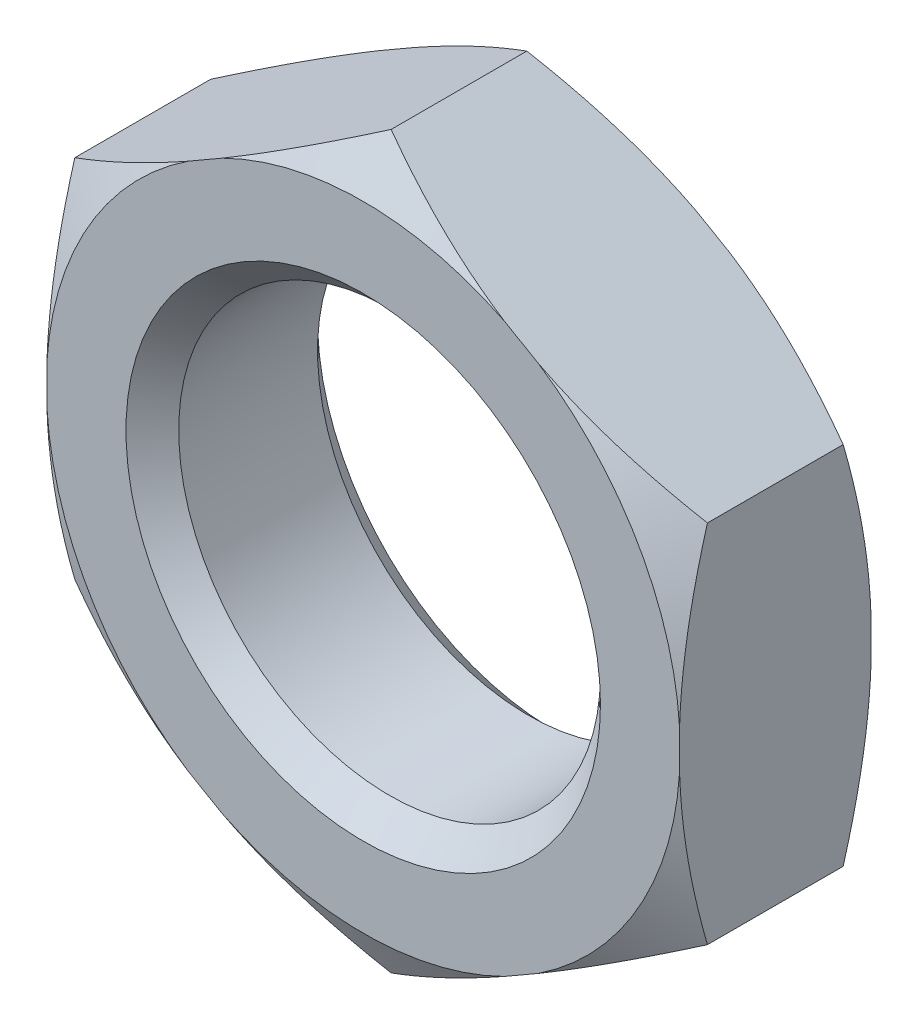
ISO-10303-21;
HEADER;
FILE_DESCRIPTION(('STEP AP214'),'2;1');
FILE_NAME('part.step','',(''),(''),'','','');
FILE_SCHEMA(('AUTOMOTIVE_DESIGN { 1 0 10303 214 1 1 1 1 }'));
ENDSEC;
DATA;
#1=APPLICATION_CONTEXT('core data for automotive mechanical design processes');
#2=APPLICATION_PROTOCOL_DEFINITION('international standard','automotive_design',2000,#1);
#3=PRODUCT_CONTEXT('',#1,'mechanical');
#4=PRODUCT('Part','Part','',(#3));
#5=PRODUCT_RELATED_PRODUCT_CATEGORY('part','',(#4));
#6=PRODUCT_DEFINITION_FORMATION('','',#4);
#7=PRODUCT_DEFINITION_CONTEXT('part definition',#1,'design');
#8=PRODUCT_DEFINITION('design','',#6,#7);
#9=PRODUCT_DEFINITION_SHAPE('','',#8);
#10=(LENGTH_UNIT() NAMED_UNIT(*) SI_UNIT(.MILLI.,.METRE.));
#11=(NAMED_UNIT(*) PLANE_ANGLE_UNIT() SI_UNIT($,.RADIAN.));
#12=(NAMED_UNIT(*) SI_UNIT($,.STERADIAN.) SOLID_ANGLE_UNIT());
#13=UNCERTAINTY_MEASURE_WITH_UNIT(LENGTH_MEASURE(1.E-05),#10,'distance_accuracy_value','');
#14=(GEOMETRIC_REPRESENTATION_CONTEXT(3) GLOBAL_UNCERTAINTY_ASSIGNED_CONTEXT((#13)) GLOBAL_UNIT_ASSIGNED_CONTEXT((#10,
#11,#12)) REPRESENTATION_CONTEXT('',''));
#15=CARTESIAN_POINT('',(0.,0.,0.));
#16=DIRECTION('',(0.,0.,1.));
#17=DIRECTION('',(1.,0.,0.));
#18=AXIS2_PLACEMENT_3D('',#15,#16,#17);
#19=CARTESIAN_POINT('',(18.,10.3923048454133,5.45));
#20=DIRECTION('',(-0.5,-0.866025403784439,0.));
#21=DIRECTION('',(0.866025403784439,-0.5,0.));
#22=AXIS2_PLACEMENT_3D('',#19,#20,#21);
#23=PLANE('',#22);
#24=CARTESIAN_POINT('',(-12.5072979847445,28.0057015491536,1.84601470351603));
#25=CARTESIAN_POINT('',(-12.2245059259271,27.8424314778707,1.69336832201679));
#26=CARTESIAN_POINT('',(-11.9413713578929,27.6789636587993,1.54156855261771));
#27=CARTESIAN_POINT('',(-11.3743571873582,27.3515978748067,1.23982794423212));
#28=CARTESIAN_POINT('',(-11.0904775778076,27.1876999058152,1.08988712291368));
#29=CARTESIAN_POINT('',(-10.2375730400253,26.6952752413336,0.643071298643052));
#30=CARTESIAN_POINT('',(-9.66734821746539,26.36605578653,0.349238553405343));
#31=CARTESIAN_POINT('',(-8.52135894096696,25.7044185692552,-0.229590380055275));
#32=CARTESIAN_POINT('',(-7.94558258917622,25.3719939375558,-0.514555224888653));
#33=CARTESIAN_POINT('',(-6.78971862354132,24.7046555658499,-1.07255585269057));
#34=CARTESIAN_POINT('',(-6.20963114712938,24.3697419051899,-1.34559201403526));
#35=CARTESIAN_POINT('',(-5.02961521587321,23.6884593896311,-1.88388713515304));
#36=CARTESIAN_POINT('',(-4.42955778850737,23.3420160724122,-2.1487707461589));
#37=CARTESIAN_POINT('',(-3.22338644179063,22.6456327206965,-2.65968989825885));
#38=CARTESIAN_POINT('',(-2.61727222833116,22.295692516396,-2.90572451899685));
#39=CARTESIAN_POINT('',(-1.39887283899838,21.5922493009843,-3.37426308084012));
#40=CARTESIAN_POINT('',(-0.786594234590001,21.2387500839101,-3.59678966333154));
#41=CARTESIAN_POINT('',(0.445234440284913,20.5275534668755,-4.01319187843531));
#42=CARTESIAN_POINT('',(1.06478356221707,20.1698566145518,-4.20707120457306));
#43=CARTESIAN_POINT('',(2.11706652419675,19.5623207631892,-4.50497866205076));
#44=CARTESIAN_POINT('',(2.5478528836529,19.313606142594,-4.6181791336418));
#45=CARTESIAN_POINT('',(3.41280827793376,18.8142239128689,-4.82590287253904));
#46=CARTESIAN_POINT('',(3.84697724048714,18.5635563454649,-4.92042653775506));
#47=CARTESIAN_POINT('',(4.71823463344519,18.0605356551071,-5.08866119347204));
#48=CARTESIAN_POINT('',(5.15532227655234,17.8081829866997,-5.16237758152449));
#49=CARTESIAN_POINT('',(6.0319353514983,17.3020701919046,-5.28713533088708));
#50=CARTESIAN_POINT('',(6.47146076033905,17.0483100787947,-5.33817690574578));
#51=CARTESIAN_POINT('',(7.34700899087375,16.542812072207,-5.415674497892));
#52=CARTESIAN_POINT('',(7.78301314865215,16.2910849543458,-5.4424093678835));
#53=CARTESIAN_POINT('',(8.65563191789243,15.787278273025,-5.471506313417));
#54=CARTESIAN_POINT('',(9.09224652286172,15.5351987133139,-5.47386864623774));
#55=CARTESIAN_POINT('',(9.96505640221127,15.03128169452,-5.45414650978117));
#56=CARTESIAN_POINT('',(10.4012516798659,14.7794442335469,-5.43206223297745));
#57=CARTESIAN_POINT('',(11.2722970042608,14.2765459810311,-5.3641152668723));
#58=CARTESIAN_POINT('',(11.7071468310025,14.0254853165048,-5.31824887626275));
#59=CARTESIAN_POINT('',(12.7339573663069,13.43265597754,-5.18302952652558));
#60=CARTESIAN_POINT('',(13.3249590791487,13.0914409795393,-5.08389172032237));
#61=CARTESIAN_POINT('',(14.50131757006,12.4122700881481,-4.84816817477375));
#62=CARTESIAN_POINT('',(15.0866735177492,12.074314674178,-4.7115770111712));
#63=CARTESIAN_POINT('',(16.2516644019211,11.4017068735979,-4.40610220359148));
#64=CARTESIAN_POINT('',(16.8312920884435,11.0670586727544,-4.23718207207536));
#65=CARTESIAN_POINT('',(17.9840453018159,10.4015162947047,-3.8723720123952));
#66=CARTESIAN_POINT('',(18.5571712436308,10.0706218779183,-3.67648381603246));
#67=CARTESIAN_POINT('',(19.7041180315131,9.40843184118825,-3.2599221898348));
#68=CARTESIAN_POINT('',(20.2778652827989,9.0771787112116,-3.03898046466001));
#69=CARTESIAN_POINT('',(21.4192808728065,8.4181821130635,-2.57850814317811));
#70=CARTESIAN_POINT('',(21.9869529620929,8.09043647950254,-2.33898987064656));
#71=CARTESIAN_POINT('',(23.1170889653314,7.43795215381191,-1.84467194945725));
#72=CARTESIAN_POINT('',(23.6795542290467,7.11321268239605,-1.58987639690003));
#73=CARTESIAN_POINT('',(24.8001368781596,6.4662439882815,-1.06763619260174));
#74=CARTESIAN_POINT('',(25.3582536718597,6.14401510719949,-0.800189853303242));
#75=CARTESIAN_POINT('',(26.3025094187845,5.5988487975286,-0.337284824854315));
#76=CARTESIAN_POINT('',(26.6896368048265,5.3753406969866,-0.144503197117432));
#77=CARTESIAN_POINT('',(27.4621851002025,4.92930973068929,0.245525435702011));
#78=CARTESIAN_POINT('',(27.8476060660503,4.7067868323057,0.442772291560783));
#79=CARTESIAN_POINT('',(28.6128368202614,4.26498065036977,0.839088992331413));
#80=CARTESIAN_POINT('',(28.9926627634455,4.04568803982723,1.03811730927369));
#81=CARTESIAN_POINT('',(29.7509618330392,3.60788386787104,1.43960243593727));
#82=CARTESIAN_POINT('',(30.1294349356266,3.38937232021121,1.64205930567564));
#83=CARTESIAN_POINT('',(30.5072979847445,3.17121298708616,1.84601470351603));
#84=B_SPLINE_CURVE_WITH_KNOTS('',3,(#24,#25,#26,#27,#28,#29,#30,#31,#32,#33,#34,#35,#36,#37,#38,
#39,#40,#41,#42,#43,#44,#45,#46,#47,#48,#49,#50,#51,#52,#53,#54,#55,#56,#57,#58,#59,#60,#61,#62,
#63,#64,#65,#66,#67,#68,#69,#70,#71,#72,#73,#74,#75,#76,#77,#78,#79,#80,#81,#82,#83),
.UNSPECIFIED.,.F.,.F.,(4,2,2,2,2,2,2,2,2,2,2,2,2,2,2,2,2,2,2,2,2,2,2,2,2,2,2,2,2,4),(0.,
1.08136929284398,2.16274885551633,4.3257597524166,6.49570389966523,8.66557916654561,
10.8907350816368,13.1159995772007,15.3391009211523,17.5619153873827,19.0920532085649,
20.6221584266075,22.1518663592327,23.6815598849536,25.1934744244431,26.7053730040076,
28.2172596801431,29.7293817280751,31.7969112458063,33.8647403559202,35.9349171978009,
38.004961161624,40.0997509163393,42.1931626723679,44.2860156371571,46.3791485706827,
47.8395678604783,49.2999384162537,50.7448189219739,52.1897247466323),.UNSPECIFIED.);
#85=CARTESIAN_POINT('',(0.,20.7846096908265,-3.86228675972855));
#86=VERTEX_POINT('',#85);
#87=CARTESIAN_POINT('',(8.03285987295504,16.1468358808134,-5.45));
#88=VERTEX_POINT('',#87);
#89=EDGE_CURVE('E177',#86,#88,#84,.T.);
#90=ORIENTED_EDGE('',*,*,#89,.F.);
#91=DIRECTION('',(0.,0.,-1.));
#92=VECTOR('',#91,1.);
#93=CARTESIAN_POINT('',(0.,20.7846096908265,5.45));
#94=LINE('',#93,#92);
#95=CARTESIAN_POINT('',(0.,20.7846096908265,3.86228675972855));
#96=VERTEX_POINT('',#95);
#97=EDGE_CURVE('E222',#96,#86,#94,.T.);
#98=ORIENTED_EDGE('',*,*,#97,.F.);
#99=CARTESIAN_POINT('',(30.5072979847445,3.17121298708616,-1.84601470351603));
#100=CARTESIAN_POINT('',(30.2245059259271,3.33448305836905,-1.69336832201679));
#101=CARTESIAN_POINT('',(29.9413713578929,3.49795087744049,-1.54156855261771));
#102=CARTESIAN_POINT('',(29.3743571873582,3.82531666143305,-1.23982794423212));
#103=CARTESIAN_POINT('',(29.0904775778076,3.98921463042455,-1.08988712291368));
#104=CARTESIAN_POINT('',(28.2375730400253,4.48163929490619,-0.643071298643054));
#105=CARTESIAN_POINT('',(27.6673482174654,4.81085874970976,-0.349238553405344));
#106=CARTESIAN_POINT('',(26.5213589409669,5.47249596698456,0.229590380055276));
#107=CARTESIAN_POINT('',(25.9455825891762,5.80492059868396,0.514555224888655));
#108=CARTESIAN_POINT('',(24.7897186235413,6.47225897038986,1.07255585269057));
#109=CARTESIAN_POINT('',(24.2096311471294,6.80717263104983,1.34559201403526));
#110=CARTESIAN_POINT('',(23.0296152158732,7.48845514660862,1.88388713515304));
#111=CARTESIAN_POINT('',(22.4295577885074,7.83489846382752,2.1487707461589));
#112=CARTESIAN_POINT('',(21.2233864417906,8.53128181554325,2.65968989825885));
#113=CARTESIAN_POINT('',(20.6172722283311,8.88122201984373,2.90572451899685));
#114=CARTESIAN_POINT('',(19.3988728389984,9.58466523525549,3.37426308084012));
#115=CARTESIAN_POINT('',(18.78659423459,9.93816445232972,3.59678966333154));
#116=CARTESIAN_POINT('',(17.5547655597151,10.6493610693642,4.01319187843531));
#117=CARTESIAN_POINT('',(16.9352164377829,11.007057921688,4.20707120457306));
#118=CARTESIAN_POINT('',(15.8829334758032,11.6145937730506,4.50497866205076));
#119=CARTESIAN_POINT('',(15.4521471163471,11.8633083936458,4.6181791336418));
#120=CARTESIAN_POINT('',(14.5871917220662,12.3626906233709,4.82590287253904));
#121=CARTESIAN_POINT('',(14.1530227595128,12.6133581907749,4.92042653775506));
#122=CARTESIAN_POINT('',(13.2817653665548,13.1163788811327,5.08866119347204));
#123=CARTESIAN_POINT('',(12.8446777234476,13.36873154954,5.16237758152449));
#124=CARTESIAN_POINT('',(11.9680646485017,13.8748443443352,5.28713533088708));
#125=CARTESIAN_POINT('',(11.5285392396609,14.1286044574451,5.33817690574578));
#126=CARTESIAN_POINT('',(10.6529910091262,14.6341024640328,5.415674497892));
#127=CARTESIAN_POINT('',(10.2169868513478,14.885829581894,5.4424093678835));
#128=CARTESIAN_POINT('',(9.34436808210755,15.3896362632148,5.471506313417));
#129=CARTESIAN_POINT('',(8.90775347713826,15.6417158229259,5.47386864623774));
#130=CARTESIAN_POINT('',(8.03494359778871,16.1456328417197,5.45414650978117));
#131=CARTESIAN_POINT('',(7.59874832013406,16.3974703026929,5.43206223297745));
#132=CARTESIAN_POINT('',(6.72770299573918,16.9003685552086,5.3641152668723));
#133=CARTESIAN_POINT('',(6.29285316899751,17.151429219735,5.31824887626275));
#134=CARTESIAN_POINT('',(5.26604263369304,17.7442585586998,5.18302952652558));
#135=CARTESIAN_POINT('',(4.67504092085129,18.0854735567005,5.08389172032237));
#136=CARTESIAN_POINT('',(3.49868242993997,18.7646444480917,4.84816817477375));
#137=CARTESIAN_POINT('',(2.9133264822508,19.1025998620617,4.7115770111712));
#138=CARTESIAN_POINT('',(1.7483355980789,19.7752076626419,4.40610220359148));
#139=CARTESIAN_POINT('',(1.16870791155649,20.1098558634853,4.23718207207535));
#140=CARTESIAN_POINT('',(0.0159546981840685,20.7753982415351,3.8723720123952));
#141=CARTESIAN_POINT('',(-0.557171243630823,21.1062926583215,3.67648381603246));
#142=CARTESIAN_POINT('',(-1.70411803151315,21.7684826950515,3.2599221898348));
#143=CARTESIAN_POINT('',(-2.27786528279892,22.0997358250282,3.03898046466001));
#144=CARTESIAN_POINT('',(-3.41928087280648,22.7587324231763,2.57850814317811));
#145=CARTESIAN_POINT('',(-3.98695296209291,23.0864780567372,2.33898987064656));
#146=CARTESIAN_POINT('',(-5.11708896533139,23.7389623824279,1.84467194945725));
#147=CARTESIAN_POINT('',(-5.67955422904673,24.0637018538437,1.58987639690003));
#148=CARTESIAN_POINT('',(-6.80013687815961,24.7106705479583,1.06763619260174));
#149=CARTESIAN_POINT('',(-7.35825367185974,25.0328994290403,0.800189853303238));
#150=CARTESIAN_POINT('',(-8.30250941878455,25.5780657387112,0.337284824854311));
#151=CARTESIAN_POINT('',(-8.6896368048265,25.8015738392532,0.14450319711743));
#152=CARTESIAN_POINT('',(-9.46218510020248,26.2476048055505,-0.245525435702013));
#153=CARTESIAN_POINT('',(-9.84760606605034,26.4701277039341,-0.442772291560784));
#154=CARTESIAN_POINT('',(-10.6128368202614,26.91193388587,-0.839088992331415));
#155=CARTESIAN_POINT('',(-10.9926627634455,27.1312264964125,-1.03811730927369));
#156=CARTESIAN_POINT('',(-11.7509618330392,27.5690306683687,-1.43960243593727));
#157=CARTESIAN_POINT('',(-12.1294349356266,27.7875422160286,-1.64205930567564));
#158=CARTESIAN_POINT('',(-12.5072979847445,28.0057015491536,-1.84601470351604));
#159=B_SPLINE_CURVE_WITH_KNOTS('',3,(#99,#100,#101,#102,#103,#104,#105,#106,#107,#108,#109,#110,
#111,#112,#113,#114,#115,#116,#117,#118,#119,#120,#121,#122,#123,#124,#125,#126,#127,#128,#129,
#130,#131,#132,#133,#134,#135,#136,#137,#138,#139,#140,#141,#142,#143,#144,#145,#146,#147,#148,
#149,#150,#151,#152,#153,#154,#155,#156,#157,#158),.UNSPECIFIED.,.F.,.F.,(4,2,2,2,2,2,2,2,2,2,2,
2,2,2,2,2,2,2,2,2,2,2,2,2,2,2,2,2,2,4),(0.,1.08136929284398,2.16274885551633,4.3257597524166,
6.49570389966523,8.66557916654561,10.8907350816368,13.1159995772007,15.3391009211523,
17.5619153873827,19.0920532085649,20.6221584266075,22.1518663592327,23.6815598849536,
25.1934744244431,26.7053730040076,28.2172596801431,29.7293817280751,31.7969112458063,
33.8647403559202,35.9349171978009,38.004961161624,40.0997509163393,42.1931626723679,
44.2860156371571,46.3791485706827,47.8395678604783,49.2999384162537,50.7448189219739,
52.1897247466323),.UNSPECIFIED.);
#160=CARTESIAN_POINT('',(8.03285987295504,16.1468358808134,5.45));
#161=VERTEX_POINT('',#160);
#162=EDGE_CURVE('E373',#161,#96,#159,.T.);
#163=ORIENTED_EDGE('',*,*,#162,.F.);
#164=DIRECTION('',(-0.866025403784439,0.5,0.));
#165=VECTOR('',#164,1.);
#166=CARTESIAN_POINT('',(18.,10.3923048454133,5.45));
#167=LINE('',#166,#165);
#168=CARTESIAN_POINT('',(9.96714012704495,15.0300786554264,5.45));
#169=VERTEX_POINT('',#168);
#170=EDGE_CURVE('E352',#169,#161,#167,.T.);
#171=ORIENTED_EDGE('',*,*,#170,.F.);
#172=CARTESIAN_POINT('',(18.,10.3923048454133,3.86228675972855));
#173=VERTEX_POINT('',#172);
#174=EDGE_CURVE('E194',#173,#169,#159,.T.);
#175=ORIENTED_EDGE('',*,*,#174,.F.);
#176=DIRECTION('',(0.,0.,-1.));
#177=VECTOR('',#176,1.);
#178=CARTESIAN_POINT('',(18.,10.3923048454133,5.45));
#179=LINE('',#178,#177);
#180=CARTESIAN_POINT('',(18.,10.3923048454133,-3.86228675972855));
#181=VERTEX_POINT('',#180);
#182=EDGE_CURVE('E183',#173,#181,#179,.T.);
#183=ORIENTED_EDGE('',*,*,#182,.T.);
#184=CARTESIAN_POINT('',(9.96714012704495,15.0300786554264,-5.45));
#185=VERTEX_POINT('',#184);
#186=EDGE_CURVE('E164',#185,#181,#84,.T.);
#187=ORIENTED_EDGE('',*,*,#186,.F.);
#188=DIRECTION('',(-0.866025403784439,0.5,0.));
#189=VECTOR('',#188,1.);
#190=CARTESIAN_POINT('',(18.,10.3923048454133,-5.45));
#191=LINE('',#190,#189);
#192=EDGE_CURVE('E264',#185,#88,#191,.T.);
#193=ORIENTED_EDGE('',*,*,#192,.T.);
#194=EDGE_LOOP('',(#90,#98,#163,#171,#175,#183,#187,#193));
#195=FACE_BOUND('',#194,.T.);
#196=ADVANCED_FACE('F39',(#195),#23,.F.);
#197=CARTESIAN_POINT('',(0.,20.7846096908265,5.45));
#198=DIRECTION('',(0.5,-0.866025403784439,0.));
#199=DIRECTION('',(0.866025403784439,0.5,0.));
#200=AXIS2_PLACEMENT_3D('',#197,#198,#199);
#201=PLANE('',#200);
#202=CARTESIAN_POINT('',(-30.5072979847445,3.17121298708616,1.84601470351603));
#203=CARTESIAN_POINT('',(-30.2245059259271,3.33448305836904,1.69336832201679));
#204=CARTESIAN_POINT('',(-29.9413713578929,3.49795087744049,1.54156855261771));
#205=CARTESIAN_POINT('',(-29.3743571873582,3.82531666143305,1.23982794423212));
#206=CARTESIAN_POINT('',(-29.0904775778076,3.98921463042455,1.08988712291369));
#207=CARTESIAN_POINT('',(-28.2375730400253,4.48163929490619,0.643071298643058));
#208=CARTESIAN_POINT('',(-27.6673482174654,4.81085874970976,0.349238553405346));
#209=CARTESIAN_POINT('',(-26.521358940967,5.47249596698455,-0.229590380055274));
#210=CARTESIAN_POINT('',(-25.9455825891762,5.80492059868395,-0.51455522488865));
#211=CARTESIAN_POINT('',(-24.7897186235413,6.47225897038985,-1.07255585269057));
#212=CARTESIAN_POINT('',(-24.2096311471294,6.80717263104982,-1.34559201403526));
#213=CARTESIAN_POINT('',(-23.0296152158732,7.48845514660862,-1.88388713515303));
#214=CARTESIAN_POINT('',(-22.4295577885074,7.83489846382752,-2.1487707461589));
#215=CARTESIAN_POINT('',(-21.2233864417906,8.53128181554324,-2.65968989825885));
#216=CARTESIAN_POINT('',(-20.6172722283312,8.88122201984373,-2.90572451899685));
#217=CARTESIAN_POINT('',(-19.3988728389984,9.58466523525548,-3.37426308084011));
#218=CARTESIAN_POINT('',(-18.78659423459,9.93816445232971,-3.59678966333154));
#219=CARTESIAN_POINT('',(-17.5547655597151,10.6493610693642,-4.0131918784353));
#220=CARTESIAN_POINT('',(-16.9352164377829,11.007057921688,-4.20707120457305));
#221=CARTESIAN_POINT('',(-15.8829334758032,11.6145937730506,-4.50497866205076));
#222=CARTESIAN_POINT('',(-15.4521471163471,11.8633083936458,-4.6181791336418));
#223=CARTESIAN_POINT('',(-14.5871917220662,12.3626906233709,-4.82590287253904));
#224=CARTESIAN_POINT('',(-14.1530227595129,12.6133581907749,-4.92042653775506));
#225=CARTESIAN_POINT('',(-13.2817653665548,13.1163788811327,-5.08866119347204));
#226=CARTESIAN_POINT('',(-12.8446777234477,13.36873154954,-5.16237758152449));
#227=CARTESIAN_POINT('',(-11.9680646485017,13.8748443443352,-5.28713533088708));
#228=CARTESIAN_POINT('',(-11.528539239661,14.1286044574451,-5.33817690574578));
#229=CARTESIAN_POINT('',(-10.6529910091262,14.6341024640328,-5.415674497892));
#230=CARTESIAN_POINT('',(-10.2169868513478,14.885829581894,-5.4424093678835));
#231=CARTESIAN_POINT('',(-9.34436808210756,15.3896362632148,-5.471506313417));
#232=CARTESIAN_POINT('',(-8.90775347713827,15.6417158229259,-5.47386864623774));
#233=CARTESIAN_POINT('',(-8.03494359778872,16.1456328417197,-5.45414650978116));
#234=CARTESIAN_POINT('',(-7.59874832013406,16.3974703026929,-5.43206223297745));
#235=CARTESIAN_POINT('',(-6.72770299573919,16.9003685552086,-5.3641152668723));
#236=CARTESIAN_POINT('',(-6.29285316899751,17.151429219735,-5.31824887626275));
#237=CARTESIAN_POINT('',(-5.26604263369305,17.7442585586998,-5.18302952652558));
#238=CARTESIAN_POINT('',(-4.6750409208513,18.0854735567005,-5.08389172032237));
#239=CARTESIAN_POINT('',(-3.49868242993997,18.7646444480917,-4.84816817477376));
#240=CARTESIAN_POINT('',(-2.91332648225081,19.1025998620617,-4.7115770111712));
#241=CARTESIAN_POINT('',(-1.74833559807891,19.7752076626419,-4.40610220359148));
#242=CARTESIAN_POINT('',(-1.16870791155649,20.1098558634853,-4.23718207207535));
#243=CARTESIAN_POINT('',(-0.0159546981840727,20.7753982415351,-3.8723720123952));
#244=CARTESIAN_POINT('',(0.557171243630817,21.1062926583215,-3.67648381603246));
#245=CARTESIAN_POINT('',(1.70411803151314,21.7684826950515,-3.2599221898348));
#246=CARTESIAN_POINT('',(2.27786528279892,22.0997358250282,-3.03898046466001));
#247=CARTESIAN_POINT('',(3.41928087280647,22.7587324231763,-2.57850814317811));
#248=CARTESIAN_POINT('',(3.9869529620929,23.0864780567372,-2.33898987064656));
#249=CARTESIAN_POINT('',(5.11708896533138,23.7389623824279,-1.84467194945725));
#250=CARTESIAN_POINT('',(5.67955422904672,24.0637018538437,-1.58987639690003));
#251=CARTESIAN_POINT('',(6.8001368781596,24.7106705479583,-1.06763619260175));
#252=CARTESIAN_POINT('',(7.35825367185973,25.0328994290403,-0.800189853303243));
#253=CARTESIAN_POINT('',(8.30250941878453,25.5780657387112,-0.337284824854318));
#254=CARTESIAN_POINT('',(8.68963680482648,25.8015738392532,-0.144503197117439));
#255=CARTESIAN_POINT('',(9.46218510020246,26.2476048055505,0.245525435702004));
#256=CARTESIAN_POINT('',(9.84760606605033,26.4701277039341,0.442772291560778));
#257=CARTESIAN_POINT('',(10.6128368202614,26.91193388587,0.839088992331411));
#258=CARTESIAN_POINT('',(10.9926627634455,27.1312264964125,1.03811730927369));
#259=CARTESIAN_POINT('',(11.7509618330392,27.5690306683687,1.43960243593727));
#260=CARTESIAN_POINT('',(12.1294349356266,27.7875422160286,1.64205930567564));
#261=CARTESIAN_POINT('',(12.5072979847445,28.0057015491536,1.84601470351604));
#262=B_SPLINE_CURVE_WITH_KNOTS('',3,(#202,#203,#204,#205,#206,#207,#208,#209,#210,#211,#212,
#213,#214,#215,#216,#217,#218,#219,#220,#221,#222,#223,#224,#225,#226,#227,#228,#229,#230,#231,
#232,#233,#234,#235,#236,#237,#238,#239,#240,#241,#242,#243,#244,#245,#246,#247,#248,#249,#250,
#251,#252,#253,#254,#255,#256,#257,#258,#259,#260,#261),.UNSPECIFIED.,.F.,.F.,(4,2,2,2,2,2,2,2,
2,2,2,2,2,2,2,2,2,2,2,2,2,2,2,2,2,2,2,2,2,4),(0.,1.08136929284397,2.16274885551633,
4.32575975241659,6.49570389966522,8.6655791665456,10.8907350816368,13.1159995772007,
15.3391009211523,17.5619153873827,19.0920532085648,20.6221584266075,22.1518663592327,
23.6815598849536,25.1934744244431,26.7053730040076,28.2172596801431,29.7293817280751,
31.7969112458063,33.8647403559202,35.9349171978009,38.004961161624,40.0997509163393,
42.1931626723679,44.2860156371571,46.3791485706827,47.8395678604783,49.2999384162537,
50.744818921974,52.1897247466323),.UNSPECIFIED.);
#263=CARTESIAN_POINT('',(-18.,10.3923048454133,-3.86228675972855));
#264=VERTEX_POINT('',#263);
#265=CARTESIAN_POINT('',(-9.96714012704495,15.0300786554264,-5.45));
#266=VERTEX_POINT('',#265);
#267=EDGE_CURVE('E55',#264,#266,#262,.T.);
#268=ORIENTED_EDGE('',*,*,#267,.F.);
#269=DIRECTION('',(0.,0.,-1.));
#270=VECTOR('',#269,1.);
#271=CARTESIAN_POINT('',(-18.,10.3923048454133,5.45));
#272=LINE('',#271,#270);
#273=CARTESIAN_POINT('',(-18.,10.3923048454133,3.86228675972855));
#274=VERTEX_POINT('',#273);
#275=EDGE_CURVE('E218',#274,#264,#272,.T.);
#276=ORIENTED_EDGE('',*,*,#275,.F.);
#277=CARTESIAN_POINT('',(12.5072979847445,28.0057015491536,-1.84601470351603));
#278=CARTESIAN_POINT('',(12.2245059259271,27.8424314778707,-1.69336832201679));
#279=CARTESIAN_POINT('',(11.9413713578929,27.6789636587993,-1.54156855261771));
#280=CARTESIAN_POINT('',(11.3743571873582,27.3515978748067,-1.23982794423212));
#281=CARTESIAN_POINT('',(11.0904775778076,27.1876999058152,-1.08988712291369));
#282=CARTESIAN_POINT('',(10.2375730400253,26.6952752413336,-0.643071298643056));
#283=CARTESIAN_POINT('',(9.6673482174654,26.36605578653,-0.349238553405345));
#284=CARTESIAN_POINT('',(8.52135894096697,25.7044185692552,0.229590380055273));
#285=CARTESIAN_POINT('',(7.94558258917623,25.3719939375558,0.514555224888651));
#286=CARTESIAN_POINT('',(6.78971862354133,24.7046555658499,1.07255585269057));
#287=CARTESIAN_POINT('',(6.20963114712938,24.3697419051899,1.34559201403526));
#288=CARTESIAN_POINT('',(5.02961521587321,23.6884593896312,1.88388713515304));
#289=CARTESIAN_POINT('',(4.42955778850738,23.3420160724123,2.1487707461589));
#290=CARTESIAN_POINT('',(3.22338644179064,22.6456327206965,2.65968989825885));
#291=CARTESIAN_POINT('',(2.61727222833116,22.295692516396,2.90572451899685));
#292=CARTESIAN_POINT('',(1.39887283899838,21.5922493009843,3.37426308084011));
#293=CARTESIAN_POINT('',(0.786594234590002,21.2387500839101,3.59678966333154));
#294=CARTESIAN_POINT('',(-0.445234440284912,20.5275534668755,4.0131918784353));
#295=CARTESIAN_POINT('',(-1.06478356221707,20.1698566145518,4.20707120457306));
#296=CARTESIAN_POINT('',(-2.11706652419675,19.5623207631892,4.50497866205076));
#297=CARTESIAN_POINT('',(-2.5478528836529,19.313606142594,4.6181791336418));
#298=CARTESIAN_POINT('',(-3.41280827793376,18.8142239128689,4.82590287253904));
#299=CARTESIAN_POINT('',(-3.84697724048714,18.5635563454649,4.92042653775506));
#300=CARTESIAN_POINT('',(-4.71823463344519,18.0605356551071,5.08866119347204));
#301=CARTESIAN_POINT('',(-5.15532227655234,17.8081829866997,5.16237758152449));
#302=CARTESIAN_POINT('',(-6.0319353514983,17.3020701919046,5.28713533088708));
#303=CARTESIAN_POINT('',(-6.47146076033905,17.0483100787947,5.33817690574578));
#304=CARTESIAN_POINT('',(-7.34700899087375,16.542812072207,5.415674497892));
#305=CARTESIAN_POINT('',(-7.78301314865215,16.2910849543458,5.4424093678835));
#306=CARTESIAN_POINT('',(-8.65563191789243,15.787278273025,5.471506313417));
#307=CARTESIAN_POINT('',(-9.09224652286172,15.5351987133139,5.47386864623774));
#308=CARTESIAN_POINT('',(-9.96505640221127,15.03128169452,5.45414650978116));
#309=CARTESIAN_POINT('',(-10.4012516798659,14.7794442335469,5.43206223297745));
#310=CARTESIAN_POINT('',(-11.2722970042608,14.2765459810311,5.3641152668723));
#311=CARTESIAN_POINT('',(-11.7071468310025,14.0254853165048,5.31824887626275));
#312=CARTESIAN_POINT('',(-12.7339573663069,13.43265597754,5.18302952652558));
#313=CARTESIAN_POINT('',(-13.3249590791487,13.0914409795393,5.08389172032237));
#314=CARTESIAN_POINT('',(-14.50131757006,12.4122700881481,4.84816817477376));
#315=CARTESIAN_POINT('',(-15.0866735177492,12.074314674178,4.7115770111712));
#316=CARTESIAN_POINT('',(-16.2516644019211,11.4017068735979,4.40610220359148));
#317=CARTESIAN_POINT('',(-16.8312920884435,11.0670586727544,4.23718207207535));
#318=CARTESIAN_POINT('',(-17.9840453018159,10.4015162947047,3.8723720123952));
#319=CARTESIAN_POINT('',(-18.5571712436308,10.0706218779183,3.67648381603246));
#320=CARTESIAN_POINT('',(-19.7041180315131,9.40843184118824,3.2599221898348));
#321=CARTESIAN_POINT('',(-20.2778652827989,9.07717871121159,3.03898046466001));
#322=CARTESIAN_POINT('',(-21.4192808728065,8.41818211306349,2.57850814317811));
#323=CARTESIAN_POINT('',(-21.9869529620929,8.09043647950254,2.33898987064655));
#324=CARTESIAN_POINT('',(-23.1170889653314,7.43795215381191,1.84467194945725));
#325=CARTESIAN_POINT('',(-23.6795542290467,7.11321268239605,1.58987639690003));
#326=CARTESIAN_POINT('',(-24.8001368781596,6.4662439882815,1.06763619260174));
#327=CARTESIAN_POINT('',(-25.3582536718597,6.14401510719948,0.800189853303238));
#328=CARTESIAN_POINT('',(-26.3025094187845,5.5988487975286,0.337284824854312));
#329=CARTESIAN_POINT('',(-26.6896368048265,5.3753406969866,0.144503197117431));
#330=CARTESIAN_POINT('',(-27.4621851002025,4.92930973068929,-0.245525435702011));
#331=CARTESIAN_POINT('',(-27.8476060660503,4.7067868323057,-0.442772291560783));
#332=CARTESIAN_POINT('',(-28.6128368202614,4.26498065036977,-0.839088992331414));
#333=CARTESIAN_POINT('',(-28.9926627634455,4.04568803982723,-1.03811730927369));
#334=CARTESIAN_POINT('',(-29.7509618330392,3.60788386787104,-1.43960243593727));
#335=CARTESIAN_POINT('',(-30.1294349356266,3.38937232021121,-1.64205930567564));
#336=CARTESIAN_POINT('',(-30.5072979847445,3.17121298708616,-1.84601470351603));
#337=B_SPLINE_CURVE_WITH_KNOTS('',3,(#277,#278,#279,#280,#281,#282,#283,#284,#285,#286,#287,
#288,#289,#290,#291,#292,#293,#294,#295,#296,#297,#298,#299,#300,#301,#302,#303,#304,#305,#306,
#307,#308,#309,#310,#311,#312,#313,#314,#315,#316,#317,#318,#319,#320,#321,#322,#323,#324,#325,
#326,#327,#328,#329,#330,#331,#332,#333,#334,#335,#336),.UNSPECIFIED.,.F.,.F.,(4,2,2,2,2,2,2,2,
2,2,2,2,2,2,2,2,2,2,2,2,2,2,2,2,2,2,2,2,2,4),(0.,1.08136929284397,2.16274885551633,
4.32575975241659,6.49570389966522,8.6655791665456,10.8907350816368,13.1159995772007,
15.3391009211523,17.5619153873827,19.0920532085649,20.6221584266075,22.1518663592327,
23.6815598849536,25.1934744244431,26.7053730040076,28.2172596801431,29.7293817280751,
31.7969112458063,33.8647403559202,35.9349171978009,38.004961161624,40.0997509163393,
42.1931626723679,44.2860156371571,46.3791485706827,47.8395678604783,49.2999384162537,
50.7448189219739,52.1897247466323),.UNSPECIFIED.);
#338=CARTESIAN_POINT('',(-9.96714012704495,15.0300786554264,5.45));
#339=VERTEX_POINT('',#338);
#340=EDGE_CURVE('E345',#339,#274,#337,.T.);
#341=ORIENTED_EDGE('',*,*,#340,.F.);
#342=DIRECTION('',(-0.866025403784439,-0.5,0.));
#343=VECTOR('',#342,1.);
#344=CARTESIAN_POINT('',(0.,20.7846096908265,5.45));
#345=LINE('',#344,#343);
#346=CARTESIAN_POINT('',(-8.03285987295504,16.1468358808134,5.45));
#347=VERTEX_POINT('',#346);
#348=EDGE_CURVE('E356',#347,#339,#345,.T.);
#349=ORIENTED_EDGE('',*,*,#348,.F.);
#350=EDGE_CURVE('E351',#96,#347,#337,.T.);
#351=ORIENTED_EDGE('',*,*,#350,.F.);
#352=ORIENTED_EDGE('',*,*,#97,.T.);
#353=CARTESIAN_POINT('',(-8.03285987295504,16.1468358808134,-5.45));
#354=VERTEX_POINT('',#353);
#355=EDGE_CURVE('E426',#354,#86,#262,.T.);
#356=ORIENTED_EDGE('',*,*,#355,.F.);
#357=DIRECTION('',(-0.866025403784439,-0.5,0.));
#358=VECTOR('',#357,1.);
#359=CARTESIAN_POINT('',(0.,20.7846096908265,-5.45));
#360=LINE('',#359,#358);
#361=EDGE_CURVE('E372',#354,#266,#360,.T.);
#362=ORIENTED_EDGE('',*,*,#361,.T.);
#363=EDGE_LOOP('',(#268,#276,#341,#349,#351,#352,#356,#362));
#364=FACE_BOUND('',#363,.T.);
#365=ADVANCED_FACE('F325',(#364),#201,.F.);
#366=CARTESIAN_POINT('',(-18.,10.3923048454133,5.45));
#367=DIRECTION('',(1.,0.,0.));
#368=DIRECTION('',(0.,1.,0.));
#369=AXIS2_PLACEMENT_3D('',#366,#367,#368);
#370=PLANE('',#369);
#371=CARTESIAN_POINT('',(-18.,-22.8996028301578,0.954290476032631));
#372=CARTESIAN_POINT('',(-18.,-22.5744407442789,0.806699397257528));
#373=CARTESIAN_POINT('',(-18.,-22.2488295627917,0.660098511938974));
#374=CARTESIAN_POINT('',(-18.,-21.5966292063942,0.369077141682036));
#375=CARTESIAN_POINT('',(-18.,-21.2700400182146,0.224656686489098));
#376=CARTESIAN_POINT('',(-18.,-20.2885893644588,-0.20507603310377));
#377=CARTESIAN_POINT('',(-18.,-19.6321537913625,-0.486810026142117));
#378=CARTESIAN_POINT('',(-18.,-18.3116874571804,-1.03988782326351));
#379=CARTESIAN_POINT('',(-18.,-17.6476364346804,-1.31118337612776));
#380=CARTESIAN_POINT('',(-18.,-16.313923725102,-1.83958180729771));
#381=CARTESIAN_POINT('',(-18.,-15.6442622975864,-2.09668533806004));
#382=CARTESIAN_POINT('',(-18.,-14.3014937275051,-2.59242814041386));
#383=CARTESIAN_POINT('',(-18.,-13.628415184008,-2.8311444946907));
#384=CARTESIAN_POINT('',(-18.,-12.2750654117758,-3.28750323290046));
#385=CARTESIAN_POINT('',(-18.,-11.5947938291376,-3.50514457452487));
#386=CARTESIAN_POINT('',(-18.,-10.2273780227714,-3.91437334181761));
#387=CARTESIAN_POINT('',(-18.,-9.5402440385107,-4.10599472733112));
#388=CARTESIAN_POINT('',(-18.,-8.15802361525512,-4.45806154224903));
#389=CARTESIAN_POINT('',(-18.,-7.46293830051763,-4.61851132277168));
#390=CARTESIAN_POINT('',(-18.,-6.26309474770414,-4.86218916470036));
#391=CARTESIAN_POINT('',(-18.,-5.76016393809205,-4.95441928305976));
#392=CARTESIAN_POINT('',(-18.,-4.75086267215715,-5.11773573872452));
#393=CARTESIAN_POINT('',(-18.,-4.2444923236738,-5.18882273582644));
#394=CARTESIAN_POINT('',(-18.,-3.22915834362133,-5.30797453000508));
#395=CARTESIAN_POINT('',(-18.,-2.72019539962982,-5.35604513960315));
#396=CARTESIAN_POINT('',(-18.,-1.70053771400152,-5.42779549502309));
#397=CARTESIAN_POINT('',(-18.,-1.18984297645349,-5.45147529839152));
#398=CARTESIAN_POINT('',(-18.,-0.168166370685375,-5.47370568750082));
#399=CARTESIAN_POINT('',(-18.,0.342815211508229,-5.47226929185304));
#400=CARTESIAN_POINT('',(-18.,1.36408355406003,-5.444344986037));
#401=CARTESIAN_POINT('',(-18.,1.87437031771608,-5.41785719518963));
#402=CARTESIAN_POINT('',(-18.,2.89314419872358,-5.34063900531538));
#403=CARTESIAN_POINT('',(-18.,3.40163112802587,-5.2899061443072));
#404=CARTESIAN_POINT('',(-18.,4.41579971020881,-5.16565842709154));
#405=CARTESIAN_POINT('',(-18.,4.92148124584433,-5.09214262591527));
#406=CARTESIAN_POINT('',(-18.,6.18186903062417,-4.88213512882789));
#407=CARTESIAN_POINT('',(-18.,6.93440306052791,-4.73254534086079));
#408=CARTESIAN_POINT('',(-18.,8.43043995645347,-4.39351494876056));
#409=CARTESIAN_POINT('',(-18.,9.17394076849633,-4.20406545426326));
#410=CARTESIAN_POINT('',(-18.,10.653389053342,-3.79202303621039));
#411=CARTESIAN_POINT('',(-18.,11.3893161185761,-3.56935754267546));
#412=CARTESIAN_POINT('',(-18.,12.8524878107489,-3.09751551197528));
#413=CARTESIAN_POINT('',(-18.,13.5797330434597,-2.84834083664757));
#414=CARTESIAN_POINT('',(-18.,15.0348420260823,-2.32569053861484));
#415=CARTESIAN_POINT('',(-18.,15.762616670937,-2.05196836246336));
#416=CARTESIAN_POINT('',(-18.,17.2113545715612,-1.48701321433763));
#417=CARTESIAN_POINT('',(-18.,17.9323173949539,-1.19577913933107));
#418=CARTESIAN_POINT('',(-18.,19.3638902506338,-0.601064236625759));
#419=CARTESIAN_POINT('',(-18.,20.0745368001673,-0.297671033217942));
#420=CARTESIAN_POINT('',(-18.,21.1366966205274,0.165879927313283));
#421=CARTESIAN_POINT('',(-18.,21.4900742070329,0.321788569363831));
#422=CARTESIAN_POINT('',(-18.,22.1956770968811,0.636175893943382));
#423=CARTESIAN_POINT('',(-18.,22.5479024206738,0.794654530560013));
#424=CARTESIAN_POINT('',(-18.,22.8996028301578,0.954290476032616));
#425=B_SPLINE_CURVE_WITH_KNOTS('',3,(#371,#372,#373,#374,#375,#376,#377,#378,#379,#380,#381,
#382,#383,#384,#385,#386,#387,#388,#389,#390,#391,#392,#393,#394,#395,#396,#397,#398,#399,#400,
#401,#402,#403,#404,#405,#406,#407,#408,#409,#410,#411,#412,#413,#414,#415,#416,#417,#418,#419,
#420,#421,#422,#423,#424),.UNSPECIFIED.,.F.,.F.,(4,2,2,2,2,2,2,2,2,2,2,2,2,2,2,2,2,2,2,2,2,2,2,
2,2,2,4),(0.,1.07126790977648,2.14255042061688,4.28547465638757,6.43733910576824,
8.58910454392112,10.7312935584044,12.8735884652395,15.0130599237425,17.1522325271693,
18.6857949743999,20.2193095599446,21.7524366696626,23.2855601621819,24.8178890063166,
26.3502105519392,27.8826877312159,29.4152284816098,31.71561395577,34.0165130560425,
36.3225148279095,38.6283547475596,40.9607175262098,43.2932273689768,45.6112022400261,
46.7699214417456,47.9286199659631),.UNSPECIFIED.);
#426=CARTESIAN_POINT('',(-18.,-10.3923048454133,-3.86228675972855));
#427=VERTEX_POINT('',#426);
#428=CARTESIAN_POINT('',(-18.,-1.11675722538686,-5.45));
#429=VERTEX_POINT('',#428);
#430=EDGE_CURVE('E63',#427,#429,#425,.T.);
#431=ORIENTED_EDGE('',*,*,#430,.F.);
#432=DIRECTION('',(0.,0.,-1.));
#433=VECTOR('',#432,1.);
#434=CARTESIAN_POINT('',(-18.,-10.3923048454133,5.45));
#435=LINE('',#434,#433);
#436=CARTESIAN_POINT('',(-18.,-10.3923048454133,3.86228675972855));
#437=VERTEX_POINT('',#436);
#438=EDGE_CURVE('E214',#437,#427,#435,.T.);
#439=ORIENTED_EDGE('',*,*,#438,.F.);
#440=CARTESIAN_POINT('',(-18.,22.8996028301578,-0.954290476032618));
#441=CARTESIAN_POINT('',(-18.,22.5744407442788,-0.806699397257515));
#442=CARTESIAN_POINT('',(-18.,22.2488295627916,-0.660098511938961));
#443=CARTESIAN_POINT('',(-18.,21.5966292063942,-0.369077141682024));
#444=CARTESIAN_POINT('',(-18.,21.2700400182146,-0.224656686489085));
#445=CARTESIAN_POINT('',(-18.,20.2885893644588,0.205076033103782));
#446=CARTESIAN_POINT('',(-18.,19.6321537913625,0.486810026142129));
#447=CARTESIAN_POINT('',(-18.,18.3116874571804,1.03988782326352));
#448=CARTESIAN_POINT('',(-18.,17.6476364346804,1.31118337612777));
#449=CARTESIAN_POINT('',(-18.,16.3139237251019,1.83958180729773));
#450=CARTESIAN_POINT('',(-18.,15.6442622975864,2.09668533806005));
#451=CARTESIAN_POINT('',(-18.,14.3014937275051,2.59242814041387));
#452=CARTESIAN_POINT('',(-18.,13.628415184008,2.83114449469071));
#453=CARTESIAN_POINT('',(-18.,12.2750654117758,3.28750323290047));
#454=CARTESIAN_POINT('',(-18.,11.5947938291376,3.50514457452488));
#455=CARTESIAN_POINT('',(-18.,10.2273780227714,3.91437334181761));
#456=CARTESIAN_POINT('',(-18.,9.54024403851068,4.10599472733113));
#457=CARTESIAN_POINT('',(-18.,8.1580236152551,4.45806154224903));
#458=CARTESIAN_POINT('',(-18.,7.4629383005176,4.61851132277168));
#459=CARTESIAN_POINT('',(-18.,6.26309474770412,4.86218916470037));
#460=CARTESIAN_POINT('',(-18.,5.76016393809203,4.95441928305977));
#461=CARTESIAN_POINT('',(-18.,4.75086267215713,5.11773573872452));
#462=CARTESIAN_POINT('',(-18.,4.24449232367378,5.18882273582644));
#463=CARTESIAN_POINT('',(-18.,3.22915834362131,5.30797453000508));
#464=CARTESIAN_POINT('',(-18.,2.7201953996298,5.35604513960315));
#465=CARTESIAN_POINT('',(-18.,1.7005377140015,5.42779549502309));
#466=CARTESIAN_POINT('',(-18.,1.18984297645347,5.45147529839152));
#467=CARTESIAN_POINT('',(-18.,0.168166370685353,5.47370568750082));
#468=CARTESIAN_POINT('',(-18.,-0.342815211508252,5.47226929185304));
#469=CARTESIAN_POINT('',(-18.,-1.36408355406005,5.444344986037));
#470=CARTESIAN_POINT('',(-18.,-1.8743703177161,5.41785719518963));
#471=CARTESIAN_POINT('',(-18.,-2.8931441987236,5.34063900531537));
#472=CARTESIAN_POINT('',(-18.,-3.40163112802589,5.2899061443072));
#473=CARTESIAN_POINT('',(-18.,-4.41579971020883,5.16565842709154));
#474=CARTESIAN_POINT('',(-18.,-4.92148124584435,5.09214262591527));
#475=CARTESIAN_POINT('',(-18.,-6.1818690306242,4.88213512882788));
#476=CARTESIAN_POINT('',(-18.,-6.93440306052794,4.73254534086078));
#477=CARTESIAN_POINT('',(-18.,-8.4304399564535,4.39351494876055));
#478=CARTESIAN_POINT('',(-18.,-9.17394076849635,4.20406545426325));
#479=CARTESIAN_POINT('',(-18.,-10.653389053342,3.79202303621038));
#480=CARTESIAN_POINT('',(-18.,-11.3893161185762,3.56935754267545));
#481=CARTESIAN_POINT('',(-18.,-12.8524878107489,3.09751551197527));
#482=CARTESIAN_POINT('',(-18.,-13.5797330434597,2.84834083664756));
#483=CARTESIAN_POINT('',(-18.,-15.0348420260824,2.32569053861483));
#484=CARTESIAN_POINT('',(-18.,-15.7626166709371,2.05196836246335));
#485=CARTESIAN_POINT('',(-18.,-17.2113545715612,1.48701321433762));
#486=CARTESIAN_POINT('',(-18.,-17.9323173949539,1.19577913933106));
#487=CARTESIAN_POINT('',(-18.,-19.3638902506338,0.601064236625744));
#488=CARTESIAN_POINT('',(-18.,-20.0745368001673,0.297671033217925));
#489=CARTESIAN_POINT('',(-18.,-21.1366966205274,-0.165879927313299));
#490=CARTESIAN_POINT('',(-18.,-21.490074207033,-0.321788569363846));
#491=CARTESIAN_POINT('',(-18.,-22.1956770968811,-0.636175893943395));
#492=CARTESIAN_POINT('',(-18.,-22.5479024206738,-0.794654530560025));
#493=CARTESIAN_POINT('',(-18.,-22.8996028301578,-0.954290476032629));
#494=B_SPLINE_CURVE_WITH_KNOTS('',3,(#440,#441,#442,#443,#444,#445,#446,#447,#448,#449,#450,
#451,#452,#453,#454,#455,#456,#457,#458,#459,#460,#461,#462,#463,#464,#465,#466,#467,#468,#469,
#470,#471,#472,#473,#474,#475,#476,#477,#478,#479,#480,#481,#482,#483,#484,#485,#486,#487,#488,
#489,#490,#491,#492,#493),.UNSPECIFIED.,.F.,.F.,(4,2,2,2,2,2,2,2,2,2,2,2,2,2,2,2,2,2,2,2,2,2,2,
2,2,2,4),(0.,1.07126790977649,2.14255042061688,4.28547465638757,6.43733910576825,
8.58910454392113,10.7312935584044,12.8735884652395,15.0130599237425,17.1522325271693,
18.6857949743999,20.2193095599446,21.7524366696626,23.2855601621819,24.8178890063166,
26.3502105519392,27.8826877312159,29.4152284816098,31.71561395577,34.0165130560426,
36.3225148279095,38.6283547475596,40.9607175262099,43.2932273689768,45.6112022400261,
46.7699214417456,47.9286199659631),.UNSPECIFIED.);
#495=CARTESIAN_POINT('',(-18.,-1.11675722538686,5.45));
#496=VERTEX_POINT('',#495);
#497=EDGE_CURVE('E331',#496,#437,#494,.T.);
#498=ORIENTED_EDGE('',*,*,#497,.F.);
#499=DIRECTION('',(0.,-1.,0.));
#500=VECTOR('',#499,1.);
#501=CARTESIAN_POINT('',(-18.,10.3923048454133,5.45));
#502=LINE('',#501,#500);
#503=CARTESIAN_POINT('',(-18.,1.11675722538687,5.45));
#504=VERTEX_POINT('',#503);
#505=EDGE_CURVE('E360',#504,#496,#502,.T.);
#506=ORIENTED_EDGE('',*,*,#505,.F.);
#507=EDGE_CURVE('E338',#274,#504,#494,.T.);
#508=ORIENTED_EDGE('',*,*,#507,.F.);
#509=ORIENTED_EDGE('',*,*,#275,.T.);
#510=CARTESIAN_POINT('',(-18.,1.11675722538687,-5.45));
#511=VERTEX_POINT('',#510);
#512=EDGE_CURVE('E314',#511,#264,#425,.T.);
#513=ORIENTED_EDGE('',*,*,#512,.F.);
#514=DIRECTION('',(0.,-1.,0.));
#515=VECTOR('',#514,1.);
#516=CARTESIAN_POINT('',(-18.,10.3923048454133,-5.45));
#517=LINE('',#516,#515);
#518=EDGE_CURVE('E377',#511,#429,#517,.T.);
#519=ORIENTED_EDGE('',*,*,#518,.T.);
#520=EDGE_LOOP('',(#431,#439,#498,#506,#508,#509,#513,#519));
#521=FACE_BOUND('',#520,.T.);
#522=ADVANCED_FACE('F321',(#521),#370,.F.);
#523=CARTESIAN_POINT('',(-18.,-10.3923048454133,5.45));
#524=DIRECTION('',(0.5,0.866025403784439,0.));
#525=DIRECTION('',(-0.866025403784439,0.5,0.));
#526=AXIS2_PLACEMENT_3D('',#523,#524,#525);
#527=PLANE('',#526);
#528=CARTESIAN_POINT('',(12.5072979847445,-28.0057015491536,1.84601470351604));
#529=CARTESIAN_POINT('',(12.2245059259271,-27.8424314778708,1.69336832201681));
#530=CARTESIAN_POINT('',(11.9413713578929,-27.6789636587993,1.54156855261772));
#531=CARTESIAN_POINT('',(11.3743571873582,-27.3515978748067,1.23982794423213));
#532=CARTESIAN_POINT('',(11.0904775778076,-27.1876999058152,1.08988712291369));
#533=CARTESIAN_POINT('',(10.2375730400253,-26.6952752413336,0.643071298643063));
#534=CARTESIAN_POINT('',(9.66734821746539,-26.36605578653,0.349238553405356));
#535=CARTESIAN_POINT('',(8.52135894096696,-25.7044185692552,-0.229590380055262));
#536=CARTESIAN_POINT('',(7.94558258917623,-25.3719939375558,-0.514555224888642));
#537=CARTESIAN_POINT('',(6.78971862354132,-24.7046555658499,-1.07255585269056));
#538=CARTESIAN_POINT('',(6.20963114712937,-24.36974190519,-1.34559201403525));
#539=CARTESIAN_POINT('',(5.0296152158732,-23.6884593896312,-1.88388713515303));
#540=CARTESIAN_POINT('',(4.42955778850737,-23.3420160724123,-2.14877074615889));
#541=CARTESIAN_POINT('',(3.22338644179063,-22.6456327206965,-2.65968989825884));
#542=CARTESIAN_POINT('',(2.61727222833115,-22.2956925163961,-2.90572451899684));
#543=CARTESIAN_POINT('',(1.39887283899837,-21.5922493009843,-3.37426308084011));
#544=CARTESIAN_POINT('',(0.786594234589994,-21.2387500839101,-3.59678966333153));
#545=CARTESIAN_POINT('',(-0.445234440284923,-20.5275534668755,-4.0131918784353));
#546=CARTESIAN_POINT('',(-1.06478356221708,-20.1698566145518,-4.20707120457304));
#547=CARTESIAN_POINT('',(-2.11706652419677,-19.5623207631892,-4.50497866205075));
#548=CARTESIAN_POINT('',(-2.54785288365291,-19.313606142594,-4.61817913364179));
#549=CARTESIAN_POINT('',(-3.41280827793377,-18.8142239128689,-4.82590287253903));
#550=CARTESIAN_POINT('',(-3.84697724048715,-18.5635563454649,-4.92042653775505));
#551=CARTESIAN_POINT('',(-4.71823463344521,-18.0605356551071,-5.08866119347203));
#552=CARTESIAN_POINT('',(-5.15532227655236,-17.8081829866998,-5.16237758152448));
#553=CARTESIAN_POINT('',(-6.03193535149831,-17.3020701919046,-5.28713533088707));
#554=CARTESIAN_POINT('',(-6.47146076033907,-17.0483100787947,-5.33817690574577));
#555=CARTESIAN_POINT('',(-7.34700899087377,-16.542812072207,-5.41567449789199));
#556=CARTESIAN_POINT('',(-7.78301314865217,-16.2910849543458,-5.44240936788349));
#557=CARTESIAN_POINT('',(-8.65563191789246,-15.787278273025,-5.47150631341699));
#558=CARTESIAN_POINT('',(-9.09224652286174,-15.5351987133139,-5.47386864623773));
#559=CARTESIAN_POINT('',(-9.9650564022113,-15.03128169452,-5.45414650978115));
#560=CARTESIAN_POINT('',(-10.401251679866,-14.7794442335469,-5.43206223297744));
#561=CARTESIAN_POINT('',(-11.2722970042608,-14.2765459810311,-5.36411526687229));
#562=CARTESIAN_POINT('',(-11.7071468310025,-14.0254853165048,-5.31824887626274));
#563=CARTESIAN_POINT('',(-12.733957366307,-13.43265597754,-5.18302952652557));
#564=CARTESIAN_POINT('',(-13.3249590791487,-13.0914409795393,-5.08389172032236));
#565=CARTESIAN_POINT('',(-14.5013175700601,-12.4122700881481,-4.84816817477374));
#566=CARTESIAN_POINT('',(-15.0866735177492,-12.074314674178,-4.71157701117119));
#567=CARTESIAN_POINT('',(-16.2516644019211,-11.4017068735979,-4.40610220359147));
#568=CARTESIAN_POINT('',(-16.8312920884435,-11.0670586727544,-4.23718207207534));
#569=CARTESIAN_POINT('',(-17.984045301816,-10.4015162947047,-3.87237201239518));
#570=CARTESIAN_POINT('',(-18.5571712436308,-10.0706218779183,-3.67648381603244));
#571=CARTESIAN_POINT('',(-19.7041180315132,-9.40843184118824,-3.25992218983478));
#572=CARTESIAN_POINT('',(-20.2778652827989,-9.07717871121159,-3.03898046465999));
#573=CARTESIAN_POINT('',(-21.4192808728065,-8.4181821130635,-2.57850814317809));
#574=CARTESIAN_POINT('',(-21.9869529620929,-8.09043647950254,-2.33898987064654));
#575=CARTESIAN_POINT('',(-23.1170889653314,-7.43795215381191,-1.84467194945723));
#576=CARTESIAN_POINT('',(-23.6795542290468,-7.11321268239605,-1.58987639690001));
#577=CARTESIAN_POINT('',(-24.8001368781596,-6.4662439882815,-1.06763619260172));
#578=CARTESIAN_POINT('',(-25.3582536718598,-6.14401510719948,-0.800189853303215));
#579=CARTESIAN_POINT('',(-26.3025094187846,-5.59884879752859,-0.337284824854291));
#580=CARTESIAN_POINT('',(-26.6896368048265,-5.3753406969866,-0.144503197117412));
#581=CARTESIAN_POINT('',(-27.4621851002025,-4.9293097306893,0.245525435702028));
#582=CARTESIAN_POINT('',(-27.8476060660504,-4.7067868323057,0.4427722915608));
#583=CARTESIAN_POINT('',(-28.6128368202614,-4.26498065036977,0.839088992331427));
#584=CARTESIAN_POINT('',(-28.9926627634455,-4.04568803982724,1.0381173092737));
#585=CARTESIAN_POINT('',(-29.7509618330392,-3.60788386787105,1.43960243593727));
#586=CARTESIAN_POINT('',(-30.1294349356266,-3.38937232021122,1.64205930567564));
#587=CARTESIAN_POINT('',(-30.5072979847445,-3.17121298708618,1.84601470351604));
#588=B_SPLINE_CURVE_WITH_KNOTS('',3,(#528,#529,#530,#531,#532,#533,#534,#535,#536,#537,#538,
#539,#540,#541,#542,#543,#544,#545,#546,#547,#548,#549,#550,#551,#552,#553,#554,#555,#556,#557,
#558,#559,#560,#561,#562,#563,#564,#565,#566,#567,#568,#569,#570,#571,#572,#573,#574,#575,#576,
#577,#578,#579,#580,#581,#582,#583,#584,#585,#586,#587),.UNSPECIFIED.,.F.,.F.,(4,2,2,2,2,2,2,2,
2,2,2,2,2,2,2,2,2,2,2,2,2,2,2,2,2,2,2,2,2,4),(0.,1.08136929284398,2.16274885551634,
4.3257597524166,6.49570389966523,8.6655791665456,10.8907350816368,13.1159995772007,
15.3391009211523,17.5619153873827,19.0920532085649,20.6221584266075,22.1518663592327,
23.6815598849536,25.1934744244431,26.7053730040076,28.2172596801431,29.7293817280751,
31.7969112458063,33.8647403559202,35.9349171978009,38.004961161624,40.0997509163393,
42.193162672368,44.2860156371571,46.3791485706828,47.8395678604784,49.2999384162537,
50.7448189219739,52.1897247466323),.UNSPECIFIED.);
#589=CARTESIAN_POINT('',(0.,-20.7846096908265,-3.86228675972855));
#590=VERTEX_POINT('',#589);
#591=CARTESIAN_POINT('',(-8.03285987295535,-16.1468358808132,-5.45));
#592=VERTEX_POINT('',#591);
#593=EDGE_CURVE('E303',#590,#592,#588,.T.);
#594=ORIENTED_EDGE('',*,*,#593,.F.);
#595=DIRECTION('',(0.,0.,-1.));
#596=VECTOR('',#595,1.);
#597=CARTESIAN_POINT('',(0.,-20.7846096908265,5.45));
#598=LINE('',#597,#596);
#599=CARTESIAN_POINT('',(0.,-20.7846096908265,3.86228675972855));
#600=VERTEX_POINT('',#599);
#601=EDGE_CURVE('E202',#600,#590,#598,.T.);
#602=ORIENTED_EDGE('',*,*,#601,.F.);
#603=CARTESIAN_POINT('',(-30.5072979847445,-3.17121298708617,-1.84601470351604));
#604=CARTESIAN_POINT('',(-30.2245059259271,-3.33448305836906,-1.69336832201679));
#605=CARTESIAN_POINT('',(-29.9413713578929,-3.49795087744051,-1.54156855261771));
#606=CARTESIAN_POINT('',(-29.3743571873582,-3.82531666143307,-1.23982794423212));
#607=CARTESIAN_POINT('',(-29.0904775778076,-3.98921463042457,-1.08988712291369));
#608=CARTESIAN_POINT('',(-28.2375730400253,-4.48163929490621,-0.643071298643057));
#609=CARTESIAN_POINT('',(-27.6673482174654,-4.81085874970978,-0.349238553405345));
#610=CARTESIAN_POINT('',(-26.521358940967,-5.47249596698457,0.229590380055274));
#611=CARTESIAN_POINT('',(-25.9455825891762,-5.80492059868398,0.51455522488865));
#612=CARTESIAN_POINT('',(-24.7897186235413,-6.47225897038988,1.07255585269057));
#613=CARTESIAN_POINT('',(-24.2096311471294,-6.80717263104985,1.34559201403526));
#614=CARTESIAN_POINT('',(-23.0296152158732,-7.48845514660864,1.88388713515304));
#615=CARTESIAN_POINT('',(-22.4295577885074,-7.83489846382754,2.1487707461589));
#616=CARTESIAN_POINT('',(-21.2233864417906,-8.53128181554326,2.65968989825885));
#617=CARTESIAN_POINT('',(-20.6172722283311,-8.88122201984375,2.90572451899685));
#618=CARTESIAN_POINT('',(-19.3988728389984,-9.58466523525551,3.37426308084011));
#619=CARTESIAN_POINT('',(-18.78659423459,-9.93816445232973,3.59678966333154));
#620=CARTESIAN_POINT('',(-17.5547655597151,-10.6493610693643,4.0131918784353));
#621=CARTESIAN_POINT('',(-16.9352164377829,-11.007057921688,4.20707120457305));
#622=CARTESIAN_POINT('',(-15.8829334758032,-11.6145937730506,4.50497866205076));
#623=CARTESIAN_POINT('',(-15.4521471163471,-11.8633083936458,4.61817913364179));
#624=CARTESIAN_POINT('',(-14.5871917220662,-12.3626906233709,4.82590287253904));
#625=CARTESIAN_POINT('',(-14.1530227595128,-12.6133581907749,4.92042653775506));
#626=CARTESIAN_POINT('',(-13.2817653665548,-13.1163788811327,5.08866119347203));
#627=CARTESIAN_POINT('',(-12.8446777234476,-13.3687315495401,5.16237758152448));
#628=CARTESIAN_POINT('',(-11.9680646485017,-13.8748443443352,5.28713533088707));
#629=CARTESIAN_POINT('',(-11.5285392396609,-14.1286044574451,5.33817690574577));
#630=CARTESIAN_POINT('',(-10.6529910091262,-14.6341024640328,5.41567449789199));
#631=CARTESIAN_POINT('',(-10.2169868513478,-14.885829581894,5.44240936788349));
#632=CARTESIAN_POINT('',(-9.34436808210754,-15.3896362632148,5.47150631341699));
#633=CARTESIAN_POINT('',(-8.90775347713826,-15.6417158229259,5.47386864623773));
#634=CARTESIAN_POINT('',(-8.03494359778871,-16.1456328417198,5.45414650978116));
#635=CARTESIAN_POINT('',(-7.59874832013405,-16.3974703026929,5.43206223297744));
#636=CARTESIAN_POINT('',(-6.72770299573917,-16.9003685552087,5.36411526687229));
#637=CARTESIAN_POINT('',(-6.2928531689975,-17.151429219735,5.31824887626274));
#638=CARTESIAN_POINT('',(-5.26604263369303,-17.7442585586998,5.18302952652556));
#639=CARTESIAN_POINT('',(-4.67504092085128,-18.0854735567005,5.08389172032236));
#640=CARTESIAN_POINT('',(-3.49868242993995,-18.7646444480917,4.84816817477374));
#641=CARTESIAN_POINT('',(-2.91332648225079,-19.1025998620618,4.71157701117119));
#642=CARTESIAN_POINT('',(-1.74833559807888,-19.7752076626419,4.40610220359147));
#643=CARTESIAN_POINT('',(-1.16870791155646,-20.1098558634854,4.23718207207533));
#644=CARTESIAN_POINT('',(-0.0159546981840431,-20.7753982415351,3.87237201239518));
#645=CARTESIAN_POINT('',(0.557171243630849,-21.1062926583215,3.67648381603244));
#646=CARTESIAN_POINT('',(1.70411803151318,-21.7684826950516,3.25992218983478));
#647=CARTESIAN_POINT('',(2.27786528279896,-22.0997358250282,3.03898046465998));
#648=CARTESIAN_POINT('',(3.41928087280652,-22.7587324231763,2.57850814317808));
#649=CARTESIAN_POINT('',(3.98695296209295,-23.0864780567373,2.33898987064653));
#650=CARTESIAN_POINT('',(5.11708896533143,-23.7389623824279,1.84467194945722));
#651=CARTESIAN_POINT('',(5.67955422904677,-24.0637018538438,1.5898763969));
#652=CARTESIAN_POINT('',(6.80013687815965,-24.7106705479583,1.06763619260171));
#653=CARTESIAN_POINT('',(7.35825367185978,-25.0328994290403,0.800189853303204));
#654=CARTESIAN_POINT('',(8.30250941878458,-25.5780657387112,0.337284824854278));
#655=CARTESIAN_POINT('',(8.68963680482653,-25.8015738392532,0.144503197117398));
#656=CARTESIAN_POINT('',(9.4621851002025,-26.2476048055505,-0.24552543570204));
#657=CARTESIAN_POINT('',(9.84760606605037,-26.4701277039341,-0.442772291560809));
#658=CARTESIAN_POINT('',(10.6128368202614,-26.91193388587,-0.839088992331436));
#659=CARTESIAN_POINT('',(10.9926627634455,-27.1312264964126,-1.03811730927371));
#660=CARTESIAN_POINT('',(11.7509618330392,-27.5690306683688,-1.43960243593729));
#661=CARTESIAN_POINT('',(12.1294349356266,-27.7875422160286,-1.64205930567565));
#662=CARTESIAN_POINT('',(12.5072979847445,-28.0057015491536,-1.84601470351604));
#663=B_SPLINE_CURVE_WITH_KNOTS('',3,(#603,#604,#605,#606,#607,#608,#609,#610,#611,#612,#613,
#614,#615,#616,#617,#618,#619,#620,#621,#622,#623,#624,#625,#626,#627,#628,#629,#630,#631,#632,
#633,#634,#635,#636,#637,#638,#639,#640,#641,#642,#643,#644,#645,#646,#647,#648,#649,#650,#651,
#652,#653,#654,#655,#656,#657,#658,#659,#660,#661,#662),.UNSPECIFIED.,.F.,.F.,(4,2,2,2,2,2,2,2,
2,2,2,2,2,2,2,2,2,2,2,2,2,2,2,2,2,2,2,2,2,4),(0.,1.08136929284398,2.16274885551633,
4.3257597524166,6.49570389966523,8.66557916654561,10.8907350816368,13.1159995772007,
15.3391009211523,17.5619153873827,19.0920532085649,20.6221584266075,22.1518663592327,
23.6815598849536,25.1934744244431,26.7053730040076,28.2172596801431,29.7293817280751,
31.7969112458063,33.8647403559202,35.9349171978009,38.004961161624,40.0997509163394,
42.193162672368,44.2860156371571,46.3791485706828,47.8395678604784,49.2999384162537,
50.744818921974,52.1897247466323),.UNSPECIFIED.);
#664=CARTESIAN_POINT('',(-8.03285987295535,-16.1468358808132,5.45));
#665=VERTEX_POINT('',#664);
#666=EDGE_CURVE('E340',#665,#600,#663,.T.);
#667=ORIENTED_EDGE('',*,*,#666,.F.);
#668=DIRECTION('',(0.866025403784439,-0.5,0.));
#669=VECTOR('',#668,1.);
#670=CARTESIAN_POINT('',(-18.,-10.3923048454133,5.45));
#671=LINE('',#670,#669);
#672=CARTESIAN_POINT('',(-9.96714012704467,-15.0300786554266,5.45));
#673=VERTEX_POINT('',#672);
#674=EDGE_CURVE('E364',#673,#665,#671,.T.);
#675=ORIENTED_EDGE('',*,*,#674,.F.);
#676=EDGE_CURVE('E339',#437,#673,#663,.T.);
#677=ORIENTED_EDGE('',*,*,#676,.F.);
#678=ORIENTED_EDGE('',*,*,#438,.T.);
#679=CARTESIAN_POINT('',(-9.96714012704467,-15.0300786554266,-5.45));
#680=VERTEX_POINT('',#679);
#681=EDGE_CURVE('E315',#680,#427,#588,.T.);
#682=ORIENTED_EDGE('',*,*,#681,.F.);
#683=DIRECTION('',(0.866025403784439,-0.5,0.));
#684=VECTOR('',#683,1.);
#685=CARTESIAN_POINT('',(-18.,-10.3923048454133,-5.45));
#686=LINE('',#685,#684);
#687=EDGE_CURVE('E380',#680,#592,#686,.T.);
#688=ORIENTED_EDGE('',*,*,#687,.T.);
#689=EDGE_LOOP('',(#594,#602,#667,#675,#677,#678,#682,#688));
#690=FACE_BOUND('',#689,.T.);
#691=ADVANCED_FACE('F324',(#690),#527,.F.);
#692=CARTESIAN_POINT('',(0.,-20.7846096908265,5.45));
#693=DIRECTION('',(-0.5,0.866025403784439,0.));
#694=DIRECTION('',(-0.866025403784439,-0.5,0.));
#695=AXIS2_PLACEMENT_3D('',#692,#693,#694);
#696=PLANE('',#695);
#697=CARTESIAN_POINT('',(30.5072979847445,-3.17121298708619,1.84601470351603));
#698=CARTESIAN_POINT('',(30.2245059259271,-3.33448305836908,1.69336832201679));
#699=CARTESIAN_POINT('',(29.9413713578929,-3.49795087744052,1.54156855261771));
#700=CARTESIAN_POINT('',(29.3743571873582,-3.82531666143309,1.23982794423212));
#701=CARTESIAN_POINT('',(29.0904775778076,-3.98921463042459,1.08988712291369));
#702=CARTESIAN_POINT('',(28.2375730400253,-4.48163929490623,0.643071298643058));
#703=CARTESIAN_POINT('',(27.6673482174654,-4.8108587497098,0.349238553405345));
#704=CARTESIAN_POINT('',(26.5213589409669,-5.47249596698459,-0.229590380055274));
#705=CARTESIAN_POINT('',(25.9455825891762,-5.80492059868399,-0.514555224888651));
#706=CARTESIAN_POINT('',(24.7897186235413,-6.4722589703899,-1.07255585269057));
#707=CARTESIAN_POINT('',(24.2096311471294,-6.80717263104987,-1.34559201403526));
#708=CARTESIAN_POINT('',(23.0296152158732,-7.48845514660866,-1.88388713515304));
#709=CARTESIAN_POINT('',(22.4295577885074,-7.83489846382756,-2.1487707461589));
#710=CARTESIAN_POINT('',(21.2233864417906,-8.53128181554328,-2.65968989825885));
#711=CARTESIAN_POINT('',(20.6172722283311,-8.88122201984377,-2.90572451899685));
#712=CARTESIAN_POINT('',(19.3988728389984,-9.58466523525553,-3.37426308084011));
#713=CARTESIAN_POINT('',(18.78659423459,-9.93816445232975,-3.59678966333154));
#714=CARTESIAN_POINT('',(17.5547655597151,-10.6493610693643,-4.0131918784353));
#715=CARTESIAN_POINT('',(16.9352164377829,-11.007057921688,-4.20707120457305));
#716=CARTESIAN_POINT('',(15.8829334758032,-11.6145937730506,-4.50497866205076));
#717=CARTESIAN_POINT('',(15.4521471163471,-11.8633083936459,-4.61817913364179));
#718=CARTESIAN_POINT('',(14.5871917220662,-12.3626906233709,-4.82590287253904));
#719=CARTESIAN_POINT('',(14.1530227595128,-12.6133581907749,-4.92042653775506));
#720=CARTESIAN_POINT('',(13.2817653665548,-13.1163788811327,-5.08866119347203));
#721=CARTESIAN_POINT('',(12.8446777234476,-13.3687315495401,-5.16237758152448));
#722=CARTESIAN_POINT('',(11.9680646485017,-13.8748443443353,-5.28713533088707));
#723=CARTESIAN_POINT('',(11.5285392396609,-14.1286044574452,-5.33817690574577));
#724=CARTESIAN_POINT('',(10.6529910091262,-14.6341024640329,-5.41567449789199));
#725=CARTESIAN_POINT('',(10.2169868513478,-14.885829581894,-5.44240936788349));
#726=CARTESIAN_POINT('',(9.34436808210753,-15.3896362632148,-5.47150631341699));
#727=CARTESIAN_POINT('',(8.90775347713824,-15.641715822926,-5.47386864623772));
#728=CARTESIAN_POINT('',(8.03494359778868,-16.1456328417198,-5.45414650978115));
#729=CARTESIAN_POINT('',(7.59874832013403,-16.3974703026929,-5.43206223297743));
#730=CARTESIAN_POINT('',(6.72770299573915,-16.9003685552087,-5.36411526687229));
#731=CARTESIAN_POINT('',(6.29285316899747,-17.1514292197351,-5.31824887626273));
#732=CARTESIAN_POINT('',(5.266042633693,-17.7442585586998,-5.18302952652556));
#733=CARTESIAN_POINT('',(4.67504092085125,-18.0854735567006,-5.08389172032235));
#734=CARTESIAN_POINT('',(3.49868242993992,-18.7646444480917,-4.84816817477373));
#735=CARTESIAN_POINT('',(2.91332648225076,-19.1025998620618,-4.71157701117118));
#736=CARTESIAN_POINT('',(1.74833559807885,-19.7752076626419,-4.40610220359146));
#737=CARTESIAN_POINT('',(1.16870791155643,-20.1098558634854,-4.23718207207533));
#738=CARTESIAN_POINT('',(0.0159546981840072,-20.7753982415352,-3.87237201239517));
#739=CARTESIAN_POINT('',(-0.557171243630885,-21.1062926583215,-3.67648381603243));
#740=CARTESIAN_POINT('',(-1.70411803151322,-21.7684826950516,-3.25992218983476));
#741=CARTESIAN_POINT('',(-2.27786528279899,-22.0997358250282,-3.03898046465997));
#742=CARTESIAN_POINT('',(-3.41928087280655,-22.7587324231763,-2.57850814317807));
#743=CARTESIAN_POINT('',(-3.98695296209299,-23.0864780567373,-2.33898987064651));
#744=CARTESIAN_POINT('',(-5.11708896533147,-23.7389623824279,-1.8446719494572));
#745=CARTESIAN_POINT('',(-5.67955422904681,-24.0637018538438,-1.58987639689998));
#746=CARTESIAN_POINT('',(-6.8001368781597,-24.7106705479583,-1.06763619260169));
#747=CARTESIAN_POINT('',(-7.35825367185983,-25.0328994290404,-0.800189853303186));
#748=CARTESIAN_POINT('',(-8.30250941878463,-25.5780657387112,-0.337284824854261));
#749=CARTESIAN_POINT('',(-8.68963680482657,-25.8015738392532,-0.144503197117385));
#750=CARTESIAN_POINT('',(-9.46218510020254,-26.2476048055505,0.245525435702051));
#751=CARTESIAN_POINT('',(-9.84760606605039,-26.4701277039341,0.442772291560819));
#752=CARTESIAN_POINT('',(-10.6128368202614,-26.91193388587,0.839088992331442));
#753=CARTESIAN_POINT('',(-10.9926627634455,-27.1312264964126,1.03811730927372));
#754=CARTESIAN_POINT('',(-11.7509618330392,-27.5690306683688,1.43960243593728));
#755=CARTESIAN_POINT('',(-12.1294349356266,-27.7875422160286,1.64205930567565));
#756=CARTESIAN_POINT('',(-12.5072979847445,-28.0057015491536,1.84601470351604));
#757=B_SPLINE_CURVE_WITH_KNOTS('',3,(#697,#698,#699,#700,#701,#702,#703,#704,#705,#706,#707,
#708,#709,#710,#711,#712,#713,#714,#715,#716,#717,#718,#719,#720,#721,#722,#723,#724,#725,#726,
#727,#728,#729,#730,#731,#732,#733,#734,#735,#736,#737,#738,#739,#740,#741,#742,#743,#744,#745,
#746,#747,#748,#749,#750,#751,#752,#753,#754,#755,#756),.UNSPECIFIED.,.F.,.F.,(4,2,2,2,2,2,2,2,
2,2,2,2,2,2,2,2,2,2,2,2,2,2,2,2,2,2,2,2,2,4),(0.,1.08136929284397,2.16274885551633,
4.3257597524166,6.49570389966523,8.66557916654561,10.8907350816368,13.1159995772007,
15.3391009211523,17.5619153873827,19.0920532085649,20.6221584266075,22.1518663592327,
23.6815598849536,25.1934744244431,26.7053730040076,28.2172596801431,29.7293817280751,
31.7969112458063,33.8647403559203,35.934917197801,38.0049611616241,40.0997509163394,
42.193162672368,44.2860156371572,46.3791485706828,47.8395678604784,49.2999384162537,
50.744818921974,52.1897247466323),.UNSPECIFIED.);
#758=CARTESIAN_POINT('',(18.,-10.3923048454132,-3.86228675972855));
#759=VERTEX_POINT('',#758);
#760=CARTESIAN_POINT('',(9.96714012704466,-15.0300786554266,-5.45));
#761=VERTEX_POINT('',#760);
#762=EDGE_CURVE('E188',#759,#761,#757,.T.);
#763=ORIENTED_EDGE('',*,*,#762,.F.);
#764=DIRECTION('',(0.,0.,-1.));
#765=VECTOR('',#764,1.);
#766=CARTESIAN_POINT('',(18.,-10.3923048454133,5.45));
#767=LINE('',#766,#765);
#768=CARTESIAN_POINT('',(18.,-10.3923048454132,3.86228675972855));
#769=VERTEX_POINT('',#768);
#770=EDGE_CURVE('E196',#769,#759,#767,.T.);
#771=ORIENTED_EDGE('',*,*,#770,.F.);
#772=CARTESIAN_POINT('',(-12.5072979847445,-28.0057015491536,-1.84601470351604));
#773=CARTESIAN_POINT('',(-12.2245059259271,-27.8424314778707,-1.6933683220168));
#774=CARTESIAN_POINT('',(-11.9413713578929,-27.6789636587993,-1.54156855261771));
#775=CARTESIAN_POINT('',(-11.3743571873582,-27.3515978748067,-1.23982794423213));
#776=CARTESIAN_POINT('',(-11.0904775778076,-27.1876999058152,-1.08988712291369));
#777=CARTESIAN_POINT('',(-10.2375730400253,-26.6952752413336,-0.643071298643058));
#778=CARTESIAN_POINT('',(-9.66734821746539,-26.36605578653,-0.349238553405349));
#779=CARTESIAN_POINT('',(-8.52135894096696,-25.7044185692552,0.229590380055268));
#780=CARTESIAN_POINT('',(-7.94558258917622,-25.3719939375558,0.514555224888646));
#781=CARTESIAN_POINT('',(-6.78971862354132,-24.7046555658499,1.07255585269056));
#782=CARTESIAN_POINT('',(-6.20963114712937,-24.36974190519,1.34559201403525));
#783=CARTESIAN_POINT('',(-5.0296152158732,-23.6884593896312,1.88388713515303));
#784=CARTESIAN_POINT('',(-4.42955778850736,-23.3420160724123,2.14877074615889));
#785=CARTESIAN_POINT('',(-3.22338644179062,-22.6456327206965,2.65968989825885));
#786=CARTESIAN_POINT('',(-2.61727222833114,-22.2956925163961,2.90572451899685));
#787=CARTESIAN_POINT('',(-1.39887283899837,-21.5922493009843,3.37426308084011));
#788=CARTESIAN_POINT('',(-0.786594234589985,-21.2387500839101,3.59678966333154));
#789=CARTESIAN_POINT('',(0.445234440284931,-20.5275534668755,4.0131918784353));
#790=CARTESIAN_POINT('',(1.06478356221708,-20.1698566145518,4.20707120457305));
#791=CARTESIAN_POINT('',(2.11706652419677,-19.5623207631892,4.50497866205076));
#792=CARTESIAN_POINT('',(2.54785288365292,-19.313606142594,4.61817913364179));
#793=CARTESIAN_POINT('',(3.41280827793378,-18.8142239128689,4.82590287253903));
#794=CARTESIAN_POINT('',(3.84697724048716,-18.5635563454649,4.92042653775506));
#795=CARTESIAN_POINT('',(4.71823463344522,-18.0605356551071,5.08866119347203));
#796=CARTESIAN_POINT('',(5.15532227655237,-17.8081829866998,5.16237758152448));
#797=CARTESIAN_POINT('',(6.03193535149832,-17.3020701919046,5.28713533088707));
#798=CARTESIAN_POINT('',(6.47146076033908,-17.0483100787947,5.33817690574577));
#799=CARTESIAN_POINT('',(7.34700899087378,-16.542812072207,5.41567449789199));
#800=CARTESIAN_POINT('',(7.78301314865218,-16.2910849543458,5.44240936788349));
#801=CARTESIAN_POINT('',(8.65563191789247,-15.787278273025,5.47150631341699));
#802=CARTESIAN_POINT('',(9.09224652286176,-15.5351987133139,5.47386864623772));
#803=CARTESIAN_POINT('',(9.96505640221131,-15.03128169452,5.45414650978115));
#804=CARTESIAN_POINT('',(10.401251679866,-14.7794442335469,5.43206223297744));
#805=CARTESIAN_POINT('',(11.2722970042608,-14.2765459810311,5.36411526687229));
#806=CARTESIAN_POINT('',(11.7071468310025,-14.0254853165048,5.31824887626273));
#807=CARTESIAN_POINT('',(12.733957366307,-13.43265597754,5.18302952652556));
#808=CARTESIAN_POINT('',(13.3249590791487,-13.0914409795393,5.08389172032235));
#809=CARTESIAN_POINT('',(14.5013175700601,-12.4122700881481,4.84816817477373));
#810=CARTESIAN_POINT('',(15.0866735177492,-12.074314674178,4.71157701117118));
#811=CARTESIAN_POINT('',(16.2516644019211,-11.4017068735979,4.40610220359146));
#812=CARTESIAN_POINT('',(16.8312920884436,-11.0670586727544,4.23718207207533));
#813=CARTESIAN_POINT('',(17.984045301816,-10.4015162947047,3.87237201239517));
#814=CARTESIAN_POINT('',(18.5571712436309,-10.0706218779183,3.67648381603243));
#815=CARTESIAN_POINT('',(19.7041180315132,-9.40843184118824,3.25992218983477));
#816=CARTESIAN_POINT('',(20.277865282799,-9.07717871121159,3.03898046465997));
#817=CARTESIAN_POINT('',(21.4192808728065,-8.41818211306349,2.57850814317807));
#818=CARTESIAN_POINT('',(21.986952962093,-8.09043647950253,2.33898987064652));
#819=CARTESIAN_POINT('',(23.1170889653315,-7.4379521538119,1.84467194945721));
#820=CARTESIAN_POINT('',(23.6795542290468,-7.11321268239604,1.58987639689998));
#821=CARTESIAN_POINT('',(24.8001368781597,-6.46624398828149,1.0676361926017));
#822=CARTESIAN_POINT('',(25.3582536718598,-6.14401510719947,0.800189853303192));
#823=CARTESIAN_POINT('',(26.3025094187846,-5.59884879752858,0.337284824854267));
#824=CARTESIAN_POINT('',(26.6896368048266,-5.37534069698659,0.144503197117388));
#825=CARTESIAN_POINT('',(27.4621851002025,-4.92930973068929,-0.245525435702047));
#826=CARTESIAN_POINT('',(27.8476060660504,-4.70678683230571,-0.442772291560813));
#827=CARTESIAN_POINT('',(28.6128368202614,-4.26498065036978,-0.839088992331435));
#828=CARTESIAN_POINT('',(28.9926627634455,-4.04568803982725,-1.03811730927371));
#829=CARTESIAN_POINT('',(29.7509618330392,-3.60788386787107,-1.43960243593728));
#830=CARTESIAN_POINT('',(30.1294349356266,-3.38937232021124,-1.64205930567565));
#831=CARTESIAN_POINT('',(30.5072979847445,-3.17121298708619,-1.84601470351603));
#832=B_SPLINE_CURVE_WITH_KNOTS('',3,(#772,#773,#774,#775,#776,#777,#778,#779,#780,#781,#782,
#783,#784,#785,#786,#787,#788,#789,#790,#791,#792,#793,#794,#795,#796,#797,#798,#799,#800,#801,
#802,#803,#804,#805,#806,#807,#808,#809,#810,#811,#812,#813,#814,#815,#816,#817,#818,#819,#820,
#821,#822,#823,#824,#825,#826,#827,#828,#829,#830,#831),.UNSPECIFIED.,.F.,.F.,(4,2,2,2,2,2,2,2,
2,2,2,2,2,2,2,2,2,2,2,2,2,2,2,2,2,2,2,2,2,4),(0.,1.08136929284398,2.16274885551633,
4.3257597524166,6.49570389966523,8.66557916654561,10.8907350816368,13.1159995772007,
15.3391009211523,17.5619153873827,19.0920532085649,20.6221584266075,22.1518663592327,
23.6815598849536,25.1934744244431,26.7053730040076,28.2172596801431,29.7293817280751,
31.7969112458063,33.8647403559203,35.934917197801,38.0049611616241,40.0997509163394,
42.193162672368,44.2860156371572,46.3791485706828,47.8395678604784,49.2999384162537,
50.744818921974,52.1897247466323),.UNSPECIFIED.);
#833=CARTESIAN_POINT('',(9.96714012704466,-15.0300786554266,5.45));
#834=VERTEX_POINT('',#833);
#835=EDGE_CURVE('E399',#834,#769,#832,.T.);
#836=ORIENTED_EDGE('',*,*,#835,.F.);
#837=DIRECTION('',(0.866025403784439,0.5,0.));
#838=VECTOR('',#837,1.);
#839=CARTESIAN_POINT('',(0.,-20.7846096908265,5.45));
#840=LINE('',#839,#838);
#841=CARTESIAN_POINT('',(8.03285987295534,-16.1468358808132,5.45));
#842=VERTEX_POINT('',#841);
#843=EDGE_CURVE('E206',#842,#834,#840,.T.);
#844=ORIENTED_EDGE('',*,*,#843,.F.);
#845=EDGE_CURVE('E394',#600,#842,#832,.T.);
#846=ORIENTED_EDGE('',*,*,#845,.F.);
#847=ORIENTED_EDGE('',*,*,#601,.T.);
#848=CARTESIAN_POINT('',(8.03285987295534,-16.1468358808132,-5.45));
#849=VERTEX_POINT('',#848);
#850=EDGE_CURVE('E175',#849,#590,#757,.T.);
#851=ORIENTED_EDGE('',*,*,#850,.F.);
#852=DIRECTION('',(0.866025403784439,0.5,0.));
#853=VECTOR('',#852,1.);
#854=CARTESIAN_POINT('',(0.,-20.7846096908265,-5.45));
#855=LINE('',#854,#853);
#856=EDGE_CURVE('E383',#849,#761,#855,.T.);
#857=ORIENTED_EDGE('',*,*,#856,.T.);
#858=EDGE_LOOP('',(#763,#771,#836,#844,#846,#847,#851,#857));
#859=FACE_BOUND('',#858,.T.);
#860=ADVANCED_FACE('F410',(#859),#696,.F.);
#861=CARTESIAN_POINT('',(18.,-10.3923048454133,5.45));
#862=DIRECTION('',(-1.,0.,0.));
#863=DIRECTION('',(0.,-1.,0.));
#864=AXIS2_PLACEMENT_3D('',#861,#862,#863);
#865=PLANE('',#864);
#866=CARTESIAN_POINT('',(18.,22.8996028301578,0.954290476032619));
#867=CARTESIAN_POINT('',(18.,22.5744407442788,0.80669939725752));
#868=CARTESIAN_POINT('',(18.,22.2488295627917,0.660098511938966));
#869=CARTESIAN_POINT('',(18.,21.5966292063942,0.369077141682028));
#870=CARTESIAN_POINT('',(18.,21.2700400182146,0.224656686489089));
#871=CARTESIAN_POINT('',(18.,20.2885893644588,-0.205076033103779));
#872=CARTESIAN_POINT('',(18.,19.6321537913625,-0.486810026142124));
#873=CARTESIAN_POINT('',(18.,18.3116874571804,-1.03988782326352));
#874=CARTESIAN_POINT('',(18.,17.6476364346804,-1.31118337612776));
#875=CARTESIAN_POINT('',(18.,16.313923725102,-1.83958180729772));
#876=CARTESIAN_POINT('',(18.,15.6442622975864,-2.09668533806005));
#877=CARTESIAN_POINT('',(18.,14.3014937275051,-2.59242814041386));
#878=CARTESIAN_POINT('',(18.,13.628415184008,-2.8311444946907));
#879=CARTESIAN_POINT('',(18.,12.2750654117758,-3.28750323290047));
#880=CARTESIAN_POINT('',(18.,11.5947938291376,-3.50514457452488));
#881=CARTESIAN_POINT('',(18.,10.2273780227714,-3.91437334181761));
#882=CARTESIAN_POINT('',(18.,9.54024403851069,-4.10599472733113));
#883=CARTESIAN_POINT('',(18.,8.15802361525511,-4.45806154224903));
#884=CARTESIAN_POINT('',(18.,7.46293830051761,-4.61851132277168));
#885=CARTESIAN_POINT('',(18.,6.26309474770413,-4.86218916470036));
#886=CARTESIAN_POINT('',(18.,5.76016393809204,-4.95441928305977));
#887=CARTESIAN_POINT('',(18.,4.75086267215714,-5.11773573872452));
#888=CARTESIAN_POINT('',(18.,4.24449232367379,-5.18882273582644));
#889=CARTESIAN_POINT('',(18.,3.22915834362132,-5.30797453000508));
#890=CARTESIAN_POINT('',(18.,2.72019539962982,-5.35604513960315));
#891=CARTESIAN_POINT('',(18.,1.70053771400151,-5.42779549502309));
#892=CARTESIAN_POINT('',(18.,1.18984297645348,-5.45147529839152));
#893=CARTESIAN_POINT('',(18.,0.168166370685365,-5.47370568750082));
#894=CARTESIAN_POINT('',(18.,-0.34281521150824,-5.47226929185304));
#895=CARTESIAN_POINT('',(18.,-1.36408355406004,-5.444344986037));
#896=CARTESIAN_POINT('',(18.,-1.87437031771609,-5.41785719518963));
#897=CARTESIAN_POINT('',(18.,-2.89314419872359,-5.34063900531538));
#898=CARTESIAN_POINT('',(18.,-3.40163112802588,-5.2899061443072));
#899=CARTESIAN_POINT('',(18.,-4.41579971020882,-5.16565842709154));
#900=CARTESIAN_POINT('',(18.,-4.92148124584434,-5.09214262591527));
#901=CARTESIAN_POINT('',(18.,-6.18186903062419,-4.88213512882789));
#902=CARTESIAN_POINT('',(18.,-6.93440306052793,-4.73254534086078));
#903=CARTESIAN_POINT('',(18.,-8.43043995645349,-4.39351494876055));
#904=CARTESIAN_POINT('',(18.,-9.17394076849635,-4.20406545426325));
#905=CARTESIAN_POINT('',(18.,-10.653389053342,-3.79202303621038));
#906=CARTESIAN_POINT('',(18.,-11.3893161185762,-3.56935754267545));
#907=CARTESIAN_POINT('',(18.,-12.8524878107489,-3.09751551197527));
#908=CARTESIAN_POINT('',(18.,-13.5797330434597,-2.84834083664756));
#909=CARTESIAN_POINT('',(18.,-15.0348420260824,-2.32569053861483));
#910=CARTESIAN_POINT('',(18.,-15.7626166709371,-2.05196836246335));
#911=CARTESIAN_POINT('',(18.,-17.2113545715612,-1.48701321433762));
#912=CARTESIAN_POINT('',(18.,-17.9323173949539,-1.19577913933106));
#913=CARTESIAN_POINT('',(18.,-19.3638902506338,-0.60106423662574));
#914=CARTESIAN_POINT('',(18.,-20.0745368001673,-0.29767103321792));
#915=CARTESIAN_POINT('',(18.,-21.1366966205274,0.165879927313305));
#916=CARTESIAN_POINT('',(18.,-21.490074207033,0.321788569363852));
#917=CARTESIAN_POINT('',(18.,-22.1956770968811,0.6361758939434));
#918=CARTESIAN_POINT('',(18.,-22.5479024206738,0.79465453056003));
#919=CARTESIAN_POINT('',(18.,-22.8996028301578,0.954290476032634));
#920=B_SPLINE_CURVE_WITH_KNOTS('',3,(#866,#867,#868,#869,#870,#871,#872,#873,#874,#875,#876,
#877,#878,#879,#880,#881,#882,#883,#884,#885,#886,#887,#888,#889,#890,#891,#892,#893,#894,#895,
#896,#897,#898,#899,#900,#901,#902,#903,#904,#905,#906,#907,#908,#909,#910,#911,#912,#913,#914,
#915,#916,#917,#918,#919),.UNSPECIFIED.,.F.,.F.,(4,2,2,2,2,2,2,2,2,2,2,2,2,2,2,2,2,2,2,2,2,2,2,
2,2,2,4),(0.,1.07126790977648,2.14255042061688,4.28547465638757,6.43733910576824,
8.58910454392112,10.7312935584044,12.8735884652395,15.0130599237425,17.1522325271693,
18.6857949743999,20.2193095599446,21.7524366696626,23.2855601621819,24.8178890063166,
26.3502105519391,27.8826877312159,29.4152284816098,31.71561395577,34.0165130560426,
36.3225148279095,38.6283547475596,40.9607175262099,43.2932273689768,45.6112022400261,
46.7699214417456,47.9286199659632),.UNSPECIFIED.);
#921=CARTESIAN_POINT('',(18.,1.11675722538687,-5.45));
#922=VERTEX_POINT('',#921);
#923=EDGE_CURVE('E167',#181,#922,#920,.T.);
#924=ORIENTED_EDGE('',*,*,#923,.F.);
#925=ORIENTED_EDGE('',*,*,#182,.F.);
#926=CARTESIAN_POINT('',(18.,-22.8996028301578,-0.954290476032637));
#927=CARTESIAN_POINT('',(18.,-22.5744407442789,-0.806699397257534));
#928=CARTESIAN_POINT('',(18.,-22.2488295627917,-0.660098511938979));
#929=CARTESIAN_POINT('',(18.,-21.5966292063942,-0.369077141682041));
#930=CARTESIAN_POINT('',(18.,-21.2700400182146,-0.224656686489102));
#931=CARTESIAN_POINT('',(18.,-20.2885893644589,0.205076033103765));
#932=CARTESIAN_POINT('',(18.,-19.6321537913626,0.486810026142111));
#933=CARTESIAN_POINT('',(18.,-18.3116874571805,1.03988782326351));
#934=CARTESIAN_POINT('',(18.,-17.6476364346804,1.31118337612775));
#935=CARTESIAN_POINT('',(18.,-16.313923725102,1.83958180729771));
#936=CARTESIAN_POINT('',(18.,-15.6442622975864,2.09668533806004));
#937=CARTESIAN_POINT('',(18.,-14.3014937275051,2.59242814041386));
#938=CARTESIAN_POINT('',(18.,-13.628415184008,2.8311444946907));
#939=CARTESIAN_POINT('',(18.,-12.2750654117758,3.28750323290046));
#940=CARTESIAN_POINT('',(18.,-11.5947938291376,3.50514457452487));
#941=CARTESIAN_POINT('',(18.,-10.2273780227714,3.91437334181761));
#942=CARTESIAN_POINT('',(18.,-9.5402440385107,4.10599472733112));
#943=CARTESIAN_POINT('',(18.,-8.15802361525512,4.45806154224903));
#944=CARTESIAN_POINT('',(18.,-7.46293830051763,4.61851132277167));
#945=CARTESIAN_POINT('',(18.,-6.26309474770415,4.86218916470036));
#946=CARTESIAN_POINT('',(18.,-5.76016393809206,4.95441928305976));
#947=CARTESIAN_POINT('',(18.,-4.75086267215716,5.11773573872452));
#948=CARTESIAN_POINT('',(18.,-4.2444923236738,5.18882273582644));
#949=CARTESIAN_POINT('',(18.,-3.22915834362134,5.30797453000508));
#950=CARTESIAN_POINT('',(18.,-2.72019539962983,5.35604513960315));
#951=CARTESIAN_POINT('',(18.,-1.70053771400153,5.42779549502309));
#952=CARTESIAN_POINT('',(18.,-1.1898429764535,5.45147529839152));
#953=CARTESIAN_POINT('',(18.,-0.16816637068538,5.47370568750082));
#954=CARTESIAN_POINT('',(18.,0.342815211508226,5.47226929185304));
#955=CARTESIAN_POINT('',(18.,1.36408355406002,5.444344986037));
#956=CARTESIAN_POINT('',(18.,1.87437031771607,5.41785719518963));
#957=CARTESIAN_POINT('',(18.,2.89314419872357,5.34063900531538));
#958=CARTESIAN_POINT('',(18.,3.40163112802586,5.2899061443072));
#959=CARTESIAN_POINT('',(18.,4.4157997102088,5.16565842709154));
#960=CARTESIAN_POINT('',(18.,4.92148124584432,5.09214262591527));
#961=CARTESIAN_POINT('',(18.,6.18186903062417,4.88213512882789));
#962=CARTESIAN_POINT('',(18.,6.93440306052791,4.73254534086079));
#963=CARTESIAN_POINT('',(18.,8.43043995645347,4.39351494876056));
#964=CARTESIAN_POINT('',(18.,9.17394076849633,4.20406545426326));
#965=CARTESIAN_POINT('',(18.,10.653389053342,3.79202303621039));
#966=CARTESIAN_POINT('',(18.,11.3893161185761,3.56935754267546));
#967=CARTESIAN_POINT('',(18.,12.8524878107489,3.09751551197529));
#968=CARTESIAN_POINT('',(18.,13.5797330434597,2.84834083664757));
#969=CARTESIAN_POINT('',(18.,15.0348420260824,2.32569053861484));
#970=CARTESIAN_POINT('',(18.,15.7626166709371,2.05196836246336));
#971=CARTESIAN_POINT('',(18.,17.2113545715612,1.48701321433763));
#972=CARTESIAN_POINT('',(18.,17.9323173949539,1.19577913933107));
#973=CARTESIAN_POINT('',(18.,19.3638902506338,0.601064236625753));
#974=CARTESIAN_POINT('',(18.,20.0745368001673,0.297671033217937));
#975=CARTESIAN_POINT('',(18.,21.1366966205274,-0.165879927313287));
#976=CARTESIAN_POINT('',(18.,21.490074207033,-0.321788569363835));
#977=CARTESIAN_POINT('',(18.,22.1956770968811,-0.636175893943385));
#978=CARTESIAN_POINT('',(18.,22.5479024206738,-0.794654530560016));
#979=CARTESIAN_POINT('',(18.,22.8996028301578,-0.95429047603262));
#980=B_SPLINE_CURVE_WITH_KNOTS('',3,(#926,#927,#928,#929,#930,#931,#932,#933,#934,#935,#936,
#937,#938,#939,#940,#941,#942,#943,#944,#945,#946,#947,#948,#949,#950,#951,#952,#953,#954,#955,
#956,#957,#958,#959,#960,#961,#962,#963,#964,#965,#966,#967,#968,#969,#970,#971,#972,#973,#974,
#975,#976,#977,#978,#979),.UNSPECIFIED.,.F.,.F.,(4,2,2,2,2,2,2,2,2,2,2,2,2,2,2,2,2,2,2,2,2,2,2,
2,2,2,4),(0.,1.07126790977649,2.14255042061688,4.28547465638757,6.43733910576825,
8.58910454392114,10.7312935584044,12.8735884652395,15.0130599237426,17.1522325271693,
18.6857949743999,20.2193095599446,21.7524366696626,23.2855601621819,24.8178890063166,
26.3502105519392,27.8826877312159,29.4152284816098,31.71561395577,34.0165130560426,
36.3225148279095,38.6283547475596,40.9607175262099,43.2932273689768,45.6112022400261,
46.7699214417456,47.9286199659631),.UNSPECIFIED.);
#981=CARTESIAN_POINT('',(18.,1.11675722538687,5.45));
#982=VERTEX_POINT('',#981);
#983=EDGE_CURVE('E433',#982,#173,#980,.T.);
#984=ORIENTED_EDGE('',*,*,#983,.F.);
#985=DIRECTION('',(0.,1.,0.));
#986=VECTOR('',#985,1.);
#987=CARTESIAN_POINT('',(18.,-10.3923048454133,5.45));
#988=LINE('',#987,#986);
#989=CARTESIAN_POINT('',(18.,-1.11675722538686,5.45));
#990=VERTEX_POINT('',#989);
#991=EDGE_CURVE('E197',#990,#982,#988,.T.);
#992=ORIENTED_EDGE('',*,*,#991,.F.);
#993=EDGE_CURVE('E418',#769,#990,#980,.T.);
#994=ORIENTED_EDGE('',*,*,#993,.F.);
#995=ORIENTED_EDGE('',*,*,#770,.T.);
#996=CARTESIAN_POINT('',(18.,-1.11675722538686,-5.45));
#997=VERTEX_POINT('',#996);
#998=EDGE_CURVE('E190',#997,#759,#920,.T.);
#999=ORIENTED_EDGE('',*,*,#998,.F.);
#1000=DIRECTION('',(0.,1.,0.));
#1001=VECTOR('',#1000,1.);
#1002=CARTESIAN_POINT('',(18.,-10.3923048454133,-5.45));
#1003=LINE('',#1002,#1001);
#1004=EDGE_CURVE('E186',#997,#922,#1003,.T.);
#1005=ORIENTED_EDGE('',*,*,#1004,.T.);
#1006=EDGE_LOOP('',(#924,#925,#984,#992,#994,#995,#999,#1005));
#1007=FACE_BOUND('',#1006,.T.);
#1008=ADVANCED_FACE('F181',(#1007),#865,.F.);
#1009=CARTESIAN_POINT('',(0.,0.,-5.45));
#1010=DIRECTION('',(0.,0.,1.));
#1011=DIRECTION('',(1.,0.,0.));
#1012=AXIS2_PLACEMENT_3D('',#1009,#1010,#1011);
#1013=PLANE('',#1012);
#1014=CARTESIAN_POINT('',(0.,0.,-5.45));
#1015=DIRECTION('',(0.,0.,1.));
#1016=DIRECTION('',(1.,0.,0.));
#1017=AXIS2_PLACEMENT_3D('',#1014,#1015,#1016);
#1018=CIRCLE('',#1017,13.5);
#1019=CARTESIAN_POINT('',(13.5,0.,-5.45));
#1020=VERTEX_POINT('',#1019);
#1021=EDGE_CURVE('E237',#1020,#1020,#1018,.T.);
#1022=ORIENTED_EDGE('',*,*,#1021,.T.);
#1023=EDGE_LOOP('',(#1022));
#1024=FACE_BOUND('',#1023,.T.);
#1025=CARTESIAN_POINT('',(0.,0.,-5.45));
#1026=DIRECTION('',(0.,0.,1.));
#1027=DIRECTION('',(1.,0.,0.));
#1028=AXIS2_PLACEMENT_3D('',#1025,#1026,#1027);
#1029=CIRCLE('',#1028,18.0346096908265);
#1030=EDGE_CURVE('E169',#922,#185,#1029,.T.);
#1031=ORIENTED_EDGE('',*,*,#1030,.F.);
#1032=ORIENTED_EDGE('',*,*,#1004,.F.);
#1033=CARTESIAN_POINT('',(0.,0.,-5.45));
#1034=DIRECTION('',(0.,0.,1.));
#1035=DIRECTION('',(1.,0.,0.));
#1036=AXIS2_PLACEMENT_3D('',#1033,#1034,#1035);
#1037=CIRCLE('',#1036,18.0346096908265);
#1038=EDGE_CURVE('E232',#761,#997,#1037,.T.);
#1039=ORIENTED_EDGE('',*,*,#1038,.F.);
#1040=ORIENTED_EDGE('',*,*,#856,.F.);
#1041=EDGE_CURVE('E235',#592,#849,#1037,.T.);
#1042=ORIENTED_EDGE('',*,*,#1041,.F.);
#1043=ORIENTED_EDGE('',*,*,#687,.F.);
#1044=EDGE_CURVE('E401',#429,#680,#1037,.T.);
#1045=ORIENTED_EDGE('',*,*,#1044,.F.);
#1046=ORIENTED_EDGE('',*,*,#518,.F.);
#1047=EDGE_CURVE('E402',#266,#511,#1037,.T.);
#1048=ORIENTED_EDGE('',*,*,#1047,.F.);
#1049=ORIENTED_EDGE('',*,*,#361,.F.);
#1050=EDGE_CURVE('E236',#88,#354,#1037,.T.);
#1051=ORIENTED_EDGE('',*,*,#1050,.F.);
#1052=ORIENTED_EDGE('',*,*,#192,.F.);
#1053=EDGE_LOOP('',(#1031,#1032,#1039,#1040,#1042,#1043,#1045,#1046,#1048,#1049,#1051,#1052));
#1054=FACE_BOUND('',#1053,.T.);
#1055=ADVANCED_FACE('F257',(#1024,#1054),#1013,.F.);
#1056=CARTESIAN_POINT('',(0.,0.,5.45));
#1057=DIRECTION('',(0.,0.,1.));
#1058=DIRECTION('',(1.,0.,0.));
#1059=AXIS2_PLACEMENT_3D('',#1056,#1057,#1058);
#1060=PLANE('',#1059);
#1061=CARTESIAN_POINT('',(0.,0.,5.45));
#1062=DIRECTION('',(0.,0.,1.));
#1063=DIRECTION('',(1.,0.,0.));
#1064=AXIS2_PLACEMENT_3D('',#1061,#1062,#1063);
#1065=CIRCLE('',#1064,13.5);
#1066=CARTESIAN_POINT('',(13.5,0.,5.45));
#1067=VERTEX_POINT('',#1066);
#1068=EDGE_CURVE('E11',#1067,#1067,#1065,.F.);
#1069=ORIENTED_EDGE('',*,*,#1068,.T.);
#1070=EDGE_LOOP('',(#1069));
#1071=FACE_BOUND('',#1070,.T.);
#1072=ORIENTED_EDGE('',*,*,#991,.T.);
#1073=CARTESIAN_POINT('',(0.,0.,5.45));
#1074=DIRECTION('',(0.,0.,1.));
#1075=DIRECTION('',(1.,0.,0.));
#1076=AXIS2_PLACEMENT_3D('',#1073,#1074,#1075);
#1077=CIRCLE('',#1076,18.0346096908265);
#1078=EDGE_CURVE('E425',#982,#169,#1077,.T.);
#1079=ORIENTED_EDGE('',*,*,#1078,.T.);
#1080=ORIENTED_EDGE('',*,*,#170,.T.);
#1081=CARTESIAN_POINT('',(0.,0.,5.45));
#1082=DIRECTION('',(0.,0.,1.));
#1083=DIRECTION('',(1.,0.,0.));
#1084=AXIS2_PLACEMENT_3D('',#1081,#1082,#1083);
#1085=CIRCLE('',#1084,18.0346096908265);
#1086=EDGE_CURVE('E231',#161,#347,#1085,.T.);
#1087=ORIENTED_EDGE('',*,*,#1086,.T.);
#1088=ORIENTED_EDGE('',*,*,#348,.T.);
#1089=EDGE_CURVE('E397',#339,#504,#1085,.T.);
#1090=ORIENTED_EDGE('',*,*,#1089,.T.);
#1091=ORIENTED_EDGE('',*,*,#505,.T.);
#1092=EDGE_CURVE('E431',#496,#673,#1085,.T.);
#1093=ORIENTED_EDGE('',*,*,#1092,.T.);
#1094=ORIENTED_EDGE('',*,*,#674,.T.);
#1095=EDGE_CURVE('E230',#665,#842,#1085,.T.);
#1096=ORIENTED_EDGE('',*,*,#1095,.T.);
#1097=ORIENTED_EDGE('',*,*,#843,.T.);
#1098=EDGE_CURVE('E226',#834,#990,#1085,.T.);
#1099=ORIENTED_EDGE('',*,*,#1098,.T.);
#1100=EDGE_LOOP('',(#1072,#1079,#1080,#1087,#1088,#1090,#1091,#1093,#1094,#1096,#1097,#1099));
#1101=FACE_BOUND('',#1100,.T.);
#1102=ADVANCED_FACE('F260',(#1071,#1101),#1060,.T.);
#1103=CARTESIAN_POINT('',(0.,0.,5.45));
#1104=DIRECTION('',(0.,0.,-1.));
#1105=DIRECTION('',(-1.,0.,0.));
#1106=AXIS2_PLACEMENT_3D('',#1103,#1104,#1105);
#1107=CONICAL_SURFACE('',#1106,18.0346096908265,1.0471975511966);
#1108=ORIENTED_EDGE('',*,*,#835,.T.);
#1109=ORIENTED_EDGE('',*,*,#993,.T.);
#1110=ORIENTED_EDGE('',*,*,#1098,.F.);
#1111=EDGE_LOOP('',(#1108,#1109,#1110));
#1112=FACE_BOUND('',#1111,.T.);
#1113=ADVANCED_FACE('F509',(#1112),#1107,.T.);
#1114=ORIENTED_EDGE('',*,*,#666,.T.);
#1115=ORIENTED_EDGE('',*,*,#845,.T.);
#1116=ORIENTED_EDGE('',*,*,#1095,.F.);
#1117=EDGE_LOOP('',(#1114,#1115,#1116));
#1118=FACE_BOUND('',#1117,.T.);
#1119=ADVANCED_FACE('F462',(#1118),#1107,.T.);
#1120=ORIENTED_EDGE('',*,*,#497,.T.);
#1121=ORIENTED_EDGE('',*,*,#676,.T.);
#1122=ORIENTED_EDGE('',*,*,#1092,.F.);
#1123=EDGE_LOOP('',(#1120,#1121,#1122));
#1124=FACE_BOUND('',#1123,.T.);
#1125=ADVANCED_FACE('F519',(#1124),#1107,.T.);
#1126=ORIENTED_EDGE('',*,*,#340,.T.);
#1127=ORIENTED_EDGE('',*,*,#507,.T.);
#1128=ORIENTED_EDGE('',*,*,#1089,.F.);
#1129=EDGE_LOOP('',(#1126,#1127,#1128));
#1130=FACE_BOUND('',#1129,.T.);
#1131=ADVANCED_FACE('F450',(#1130),#1107,.T.);
#1132=ORIENTED_EDGE('',*,*,#162,.T.);
#1133=ORIENTED_EDGE('',*,*,#350,.T.);
#1134=ORIENTED_EDGE('',*,*,#1086,.F.);
#1135=EDGE_LOOP('',(#1132,#1133,#1134));
#1136=FACE_BOUND('',#1135,.T.);
#1137=ADVANCED_FACE('F289',(#1136),#1107,.T.);
#1138=ORIENTED_EDGE('',*,*,#174,.T.);
#1139=ORIENTED_EDGE('',*,*,#1078,.F.);
#1140=ORIENTED_EDGE('',*,*,#983,.T.);
#1141=EDGE_LOOP('',(#1138,#1139,#1140));
#1142=FACE_BOUND('',#1141,.T.);
#1143=ADVANCED_FACE('F466',(#1142),#1107,.T.);
#1144=CARTESIAN_POINT('',(0.,0.,-5.45));
#1145=DIRECTION('',(0.,0.,1.));
#1146=DIRECTION('',(-1.,0.,0.));
#1147=AXIS2_PLACEMENT_3D('',#1144,#1145,#1146);
#1148=CONICAL_SURFACE('',#1147,18.0346096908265,1.0471975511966);
#1149=ORIENTED_EDGE('',*,*,#762,.T.);
#1150=ORIENTED_EDGE('',*,*,#1038,.T.);
#1151=ORIENTED_EDGE('',*,*,#998,.T.);
#1152=EDGE_LOOP('',(#1149,#1150,#1151));
#1153=FACE_BOUND('',#1152,.T.);
#1154=ADVANCED_FACE('F288',(#1153),#1148,.T.);
#1155=ORIENTED_EDGE('',*,*,#593,.T.);
#1156=ORIENTED_EDGE('',*,*,#1041,.T.);
#1157=ORIENTED_EDGE('',*,*,#850,.T.);
#1158=EDGE_LOOP('',(#1155,#1156,#1157));
#1159=FACE_BOUND('',#1158,.T.);
#1160=ADVANCED_FACE('F407',(#1159),#1148,.T.);
#1161=ORIENTED_EDGE('',*,*,#430,.T.);
#1162=ORIENTED_EDGE('',*,*,#1044,.T.);
#1163=ORIENTED_EDGE('',*,*,#681,.T.);
#1164=EDGE_LOOP('',(#1161,#1162,#1163));
#1165=FACE_BOUND('',#1164,.T.);
#1166=ADVANCED_FACE('F545',(#1165),#1148,.T.);
#1167=ORIENTED_EDGE('',*,*,#267,.T.);
#1168=ORIENTED_EDGE('',*,*,#1047,.T.);
#1169=ORIENTED_EDGE('',*,*,#512,.T.);
#1170=EDGE_LOOP('',(#1167,#1168,#1169));
#1171=FACE_BOUND('',#1170,.T.);
#1172=ADVANCED_FACE('F286',(#1171),#1148,.T.);
#1173=ORIENTED_EDGE('',*,*,#89,.T.);
#1174=ORIENTED_EDGE('',*,*,#1050,.T.);
#1175=ORIENTED_EDGE('',*,*,#355,.T.);
#1176=EDGE_LOOP('',(#1173,#1174,#1175));
#1177=FACE_BOUND('',#1176,.T.);
#1178=ADVANCED_FACE('F281',(#1177),#1148,.T.);
#1179=ORIENTED_EDGE('',*,*,#186,.T.);
#1180=ORIENTED_EDGE('',*,*,#923,.T.);
#1181=ORIENTED_EDGE('',*,*,#1030,.T.);
#1182=EDGE_LOOP('',(#1179,#1180,#1181));
#1183=FACE_BOUND('',#1182,.T.);
#1184=ADVANCED_FACE('F166',(#1183),#1148,.T.);
#1185=CARTESIAN_POINT('',(0.,0.,-5.45));
#1186=DIRECTION('',(0.,0.,1.));
#1187=DIRECTION('',(1.,0.,0.));
#1188=AXIS2_PLACEMENT_3D('',#1185,#1186,#1187);
#1189=CYLINDRICAL_SURFACE('',#1188,12.);
#1190=CARTESIAN_POINT('',(0.,0.,-3.95));
#1191=DIRECTION('',(0.,0.,1.));
#1192=DIRECTION('',(1.,0.,0.));
#1193=AXIS2_PLACEMENT_3D('',#1190,#1191,#1192);
#1194=CIRCLE('',#1193,12.);
#1195=CARTESIAN_POINT('',(12.,0.,-3.95));
#1196=VERTEX_POINT('',#1195);
#1197=EDGE_CURVE('E48',#1196,#1196,#1194,.F.);
#1198=ORIENTED_EDGE('',*,*,#1197,.T.);
#1199=EDGE_LOOP('',(#1198));
#1200=FACE_BOUND('',#1199,.T.);
#1201=CARTESIAN_POINT('',(0.,0.,3.95));
#1202=DIRECTION('',(0.,0.,1.));
#1203=DIRECTION('',(1.,0.,0.));
#1204=AXIS2_PLACEMENT_3D('',#1201,#1202,#1203);
#1205=CIRCLE('',#1204,12.);
#1206=CARTESIAN_POINT('',(12.,0.,3.95));
#1207=VERTEX_POINT('',#1206);
#1208=EDGE_CURVE('E241',#1207,#1207,#1205,.T.);
#1209=ORIENTED_EDGE('',*,*,#1208,.T.);
#1210=EDGE_LOOP('',(#1209));
#1211=FACE_BOUND('',#1210,.T.);
#1212=ADVANCED_FACE('F249',(#1200,#1211),#1189,.F.);
#1213=CARTESIAN_POINT('',(0.,0.,-5.45));
#1214=DIRECTION('',(0.,0.,-1.));
#1215=DIRECTION('',(-1.,0.,0.));
#1216=AXIS2_PLACEMENT_3D('',#1213,#1214,#1215);
#1217=CONICAL_SURFACE('',#1216,13.5,0.785398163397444);
#1218=ORIENTED_EDGE('',*,*,#1197,.F.);
#1219=EDGE_LOOP('',(#1218));
#1220=FACE_BOUND('',#1219,.T.);
#1221=ORIENTED_EDGE('',*,*,#1021,.F.);
#1222=EDGE_LOOP('',(#1221));
#1223=FACE_BOUND('',#1222,.T.);
#1224=ADVANCED_FACE('F252',(#1220,#1223),#1217,.F.);
#1225=CARTESIAN_POINT('',(0.,0.,3.95));
#1226=DIRECTION('',(0.,0.,1.));
#1227=DIRECTION('',(1.,0.,0.));
#1228=AXIS2_PLACEMENT_3D('',#1225,#1226,#1227);
#1229=CONICAL_SURFACE('',#1228,12.,0.785398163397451);
#1230=ORIENTED_EDGE('',*,*,#1068,.F.);
#1231=EDGE_LOOP('',(#1230));
#1232=FACE_BOUND('',#1231,.T.);
#1233=ORIENTED_EDGE('',*,*,#1208,.F.);
#1234=EDGE_LOOP('',(#1233));
#1235=FACE_BOUND('',#1234,.T.);
#1236=ADVANCED_FACE('F41',(#1232,#1235),#1229,.F.);
#1237=CLOSED_SHELL('',(#196,#365,#522,#691,#860,#1008,#1055,#1102,#1113,#1119,#1125,#1131,#1137,
#1143,#1154,#1160,#1166,#1172,#1178,#1184,#1212,#1224,#1236));
#1238=MANIFOLD_SOLID_BREP('B2',#1237);
#1239=ADVANCED_BREP_SHAPE_REPRESENTATION('',(#18,#1238),#14);
#1240=SHAPE_DEFINITION_REPRESENTATION(#9,#1239);
ENDSEC;
END-ISO-10303-21;
